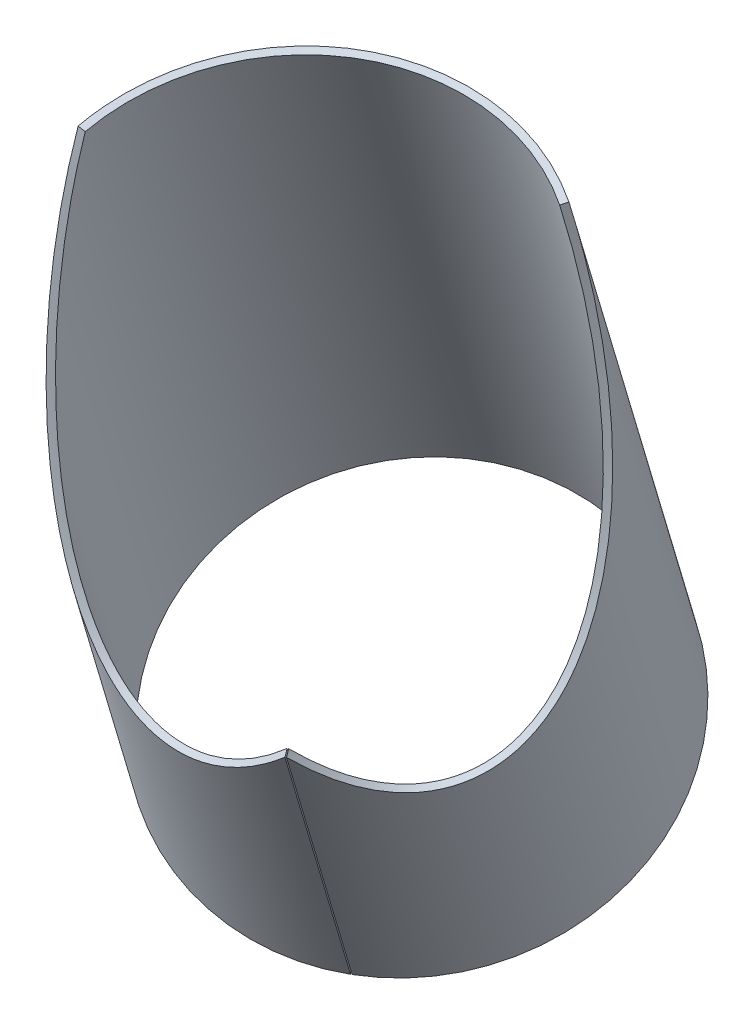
ISO-10303-21;
HEADER;
FILE_DESCRIPTION(('STEP AP214'),'2;1');
FILE_NAME('part.step','',(''),(''),'','','');
FILE_SCHEMA(('AUTOMOTIVE_DESIGN { 1 0 10303 214 1 1 1 1 }'));
ENDSEC;
DATA;
#1=APPLICATION_CONTEXT('core data for automotive mechanical design processes');
#2=APPLICATION_PROTOCOL_DEFINITION('international standard','automotive_design',2000,#1);
#3=PRODUCT_CONTEXT('',#1,'mechanical');
#4=PRODUCT('Part','Part','',(#3));
#5=PRODUCT_RELATED_PRODUCT_CATEGORY('part','',(#4));
#6=PRODUCT_DEFINITION_FORMATION('','',#4);
#7=PRODUCT_DEFINITION_CONTEXT('part definition',#1,'design');
#8=PRODUCT_DEFINITION('design','',#6,#7);
#9=PRODUCT_DEFINITION_SHAPE('','',#8);
#10=(LENGTH_UNIT() NAMED_UNIT(*) SI_UNIT(.MILLI.,.METRE.));
#11=(NAMED_UNIT(*) PLANE_ANGLE_UNIT() SI_UNIT($,.RADIAN.));
#12=(NAMED_UNIT(*) SI_UNIT($,.STERADIAN.) SOLID_ANGLE_UNIT());
#13=UNCERTAINTY_MEASURE_WITH_UNIT(LENGTH_MEASURE(1.E-05),#10,'distance_accuracy_value','');
#14=(GEOMETRIC_REPRESENTATION_CONTEXT(3) GLOBAL_UNCERTAINTY_ASSIGNED_CONTEXT((#13)) GLOBAL_UNIT_ASSIGNED_CONTEXT((#10,
#11,#12)) REPRESENTATION_CONTEXT('',''));
#15=CARTESIAN_POINT('',(0.,0.,0.));
#16=DIRECTION('',(0.,0.,1.));
#17=DIRECTION('',(1.,0.,0.));
#18=AXIS2_PLACEMENT_3D('',#15,#16,#17);
#19=CARTESIAN_POINT('',(-42.0601074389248,-492.249143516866,-71.883576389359));
#20=DIRECTION('',(0.867224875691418,-0.00138888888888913,-0.497914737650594));
#21=DIRECTION('',(0.249999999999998,0.866025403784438,0.433012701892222));
#22=AXIS2_PLACEMENT_3D('',#19,#20,#21);
#23=PLANE('',#22);
#24=DIRECTION('',(0.43060540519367,-0.499998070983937,0.751385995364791));
#25=VECTOR('',#24,1.);
#26=CARTESIAN_POINT('',(-80.9592321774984,-626.999664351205,-139.258836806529));
#27=LINE('',#26,#25);
#28=CARTESIAN_POINT('',(-80.9592321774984,-626.999664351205,-139.258836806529));
#29=VERTEX_POINT('',#28);
#30=CARTESIAN_POINT('',(-78.3755997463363,-629.999652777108,-134.75052083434));
#31=VERTEX_POINT('',#30);
#32=EDGE_CURVE('E13',#29,#31,#27,.T.);
#33=ORIENTED_EDGE('',*,*,#32,.F.);
#34=DIRECTION('',(0.249999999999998,0.866025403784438,0.433012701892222));
#35=VECTOR('',#34,1.);
#36=CARTESIAN_POINT('',(-80.9592321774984,-626.999664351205,-139.258836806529));
#37=LINE('',#36,#35);
#38=CARTESIAN_POINT('',(-3.1609827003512,-357.498622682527,-4.50831597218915));
#39=VERTEX_POINT('',#38);
#40=EDGE_CURVE('E102',#29,#39,#37,.T.);
#41=ORIENTED_EDGE('',*,*,#40,.T.);
#42=CARTESIAN_POINT('',(-0.577350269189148,-360.498611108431,-3.84241249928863E-13));
#43=CARTESIAN_POINT('',(-3.16098270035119,-357.498622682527,-4.50831597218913));
#44=B_SPLINE_CURVE_WITH_KNOTS('',1,(#42,#43),.UNSPECIFIED.,.F.,.F.,(2,2),(0.,1.),.UNSPECIFIED.);
#45=CARTESIAN_POINT('',(-0.577350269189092,-360.49861110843,2.22044604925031E-13));
#46=VERTEX_POINT('',#45);
#47=EDGE_CURVE('E50',#39,#46,#44,.F.);
#48=ORIENTED_EDGE('',*,*,#47,.T.);
#49=DIRECTION('',(0.249999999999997,0.866025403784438,0.433012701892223));
#50=VECTOR('',#49,1.);
#51=CARTESIAN_POINT('',(-413.451756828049,-1790.73750971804,-715.11944930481));
#52=LINE('',#51,#50);
#53=EDGE_CURVE('E101',#31,#46,#52,.T.);
#54=ORIENTED_EDGE('',*,*,#53,.F.);
#55=EDGE_LOOP('',(#33,#41,#48,#54));
#56=FACE_BOUND('',#55,.T.);
#57=ADVANCED_FACE('F40',(#56),#23,.T.);
#58=CARTESIAN_POINT('',(-180.,24.1154273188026,-9.64397832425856E-13));
#59=CARTESIAN_POINT('',(-182.461083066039,14.6007842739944,0.00014389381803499));
#60=CARTESIAN_POINT('',(-184.557941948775,5.89288400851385,0.00060696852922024));
#61=CARTESIAN_POINT('',(-186.810539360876,-3.95829779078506,0.000223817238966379));
#62=CARTESIAN_POINT('',(-187.242572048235,-5.87687673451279,0.000133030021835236));
#63=CARTESIAN_POINT('',(-188.071583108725,-9.61020880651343,9.26974379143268E-06));
#64=CARTESIAN_POINT('',(-188.466165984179,-11.4137400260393,-2.39107263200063E-06));
#65=CARTESIAN_POINT('',(-189.6237148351,-16.778202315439,3.87627210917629E-05));
#66=CARTESIAN_POINT('',(-190.357859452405,-20.2826731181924,0.000126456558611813));
#67=CARTESIAN_POINT('',(-192.454843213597,-30.5783400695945,0.000268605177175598));
#68=CARTESIAN_POINT('',(-193.71232683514,-37.1517226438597,0.000120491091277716));
#69=CARTESIAN_POINT('',(-195.415013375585,-46.5685711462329,-1.53885423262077E-05));
#70=CARTESIAN_POINT('',(-195.951796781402,-49.6319005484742,1.10223983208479E-05));
#71=CARTESIAN_POINT('',(-196.982891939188,-55.6979803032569,8.82721286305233E-05));
#72=CARTESIAN_POINT('',(-197.475181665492,-58.6897998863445,0.000133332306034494));
#73=CARTESIAN_POINT('',(-198.88563001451,-67.5405807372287,0.000189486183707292));
#74=CARTESIAN_POINT('',(-199.737395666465,-73.2748390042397,8.74328922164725E-05));
#75=CARTESIAN_POINT('',(-200.895174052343,-81.6232345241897,-6.72985425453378E-06));
#76=CARTESIAN_POINT('',(-201.260777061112,-84.3609839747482,-2.49691232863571E-07));
#77=CARTESIAN_POINT('',(-201.958548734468,-89.7872544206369,5.07940251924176E-05));
#78=CARTESIAN_POINT('',(-202.290146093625,-92.4718534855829,8.69713769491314E-05));
#79=CARTESIAN_POINT('',(-203.235023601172,-100.439442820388,0.000155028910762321));
#80=CARTESIAN_POINT('',(-203.798400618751,-105.636212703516,0.00012798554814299));
#81=CARTESIAN_POINT('',(-204.8022144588,-115.796951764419,8.76250503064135E-06));
#82=CARTESIAN_POINT('',(-205.242103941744,-120.752892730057,-5.27277112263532E-06));
#83=CARTESIAN_POINT('',(-206.399799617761,-135.371496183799,0.000138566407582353));
#84=CARTESIAN_POINT('',(-206.952814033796,-144.760780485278,3.74144337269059E-05));
#85=CARTESIAN_POINT('',(-207.674396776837,-162.81137585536,-3.16573914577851E-05));
#86=CARTESIAN_POINT('',(-207.845410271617,-171.532135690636,0.00029952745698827));
#87=CARTESIAN_POINT('',(-207.84651395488,-188.391103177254,0.000163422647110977));
#88=CARTESIAN_POINT('',(-207.677035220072,-196.515473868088,-0.000124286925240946));
#89=CARTESIAN_POINT('',(-207.026596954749,-212.256449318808,-3.3545841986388E-05));
#90=CARTESIAN_POINT('',(-206.545539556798,-219.862323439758,-4.51189139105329E-05));
#91=CARTESIAN_POINT('',(-205.299398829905,-234.536939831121,-2.73545987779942E-05));
#92=CARTESIAN_POINT('',(-204.532514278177,-241.626401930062,0.000122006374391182));
#93=CARTESIAN_POINT('',(-202.73335756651,-255.309182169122,8.01220048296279E-05));
#94=CARTESIAN_POINT('',(-201.702153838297,-261.895844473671,-6.60017474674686E-06));
#95=CARTESIAN_POINT('',(-199.391737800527,-274.593293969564,0.000156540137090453));
#96=CARTESIAN_POINT('',(-198.111560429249,-280.708656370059,0.000189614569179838));
#97=CARTESIAN_POINT('',(-195.319702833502,-292.467269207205,2.81779833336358E-05));
#98=CARTESIAN_POINT('',(-193.809297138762,-298.106003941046,-4.66875268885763E-05));
#99=CARTESIAN_POINT('',(-188.947870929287,-314.342156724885,0.000337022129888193));
#100=CARTESIAN_POINT('',(-185.262965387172,-324.270831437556,5.14679362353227E-05));
#101=CARTESIAN_POINT('',(-177.125928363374,-342.303283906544,-1.10318340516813E-05));
#102=CARTESIAN_POINT('',(-172.657511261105,-350.443320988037,0.000436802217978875));
#103=CARTESIAN_POINT('',(-163.020167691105,-364.950788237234,-3.23293386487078E-05));
#104=CARTESIAN_POINT('',(-157.853584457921,-371.315045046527,3.89803274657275E-05));
#105=CARTESIAN_POINT('',(-146.884406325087,-382.293952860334,-4.43082888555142E-05));
#106=CARTESIAN_POINT('',(-141.08102211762,-386.907267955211,-3.24649269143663E-05));
#107=CARTESIAN_POINT('',(-122.82356398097,-398.107543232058,5.67010380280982E-05));
#108=CARTESIAN_POINT('',(-109.498505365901,-402.071545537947,-1.37531779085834E-05));
#109=CARTESIAN_POINT('',(-88.1680375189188,-402.655029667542,-7.76606030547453E-06));
#110=CARTESIAN_POINT('',(-80.8237648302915,-401.954685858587,0.000402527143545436));
#111=CARTESIAN_POINT('',(-65.7387071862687,-398.735544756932,7.090344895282E-05));
#112=CARTESIAN_POINT('',(-58.0055462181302,-396.219132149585,0.000158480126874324));
#113=CARTESIAN_POINT('',(-42.1706997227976,-389.31539919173,0.000483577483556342));
#114=CARTESIAN_POINT('',(-34.083415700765,-384.933871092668,-8.02939817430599E-06));
#115=CARTESIAN_POINT('',(-21.7470296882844,-376.929555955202,-6.32759911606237E-05));
#116=CARTESIAN_POINT('',(-17.5965675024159,-374.01980324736,-2.96445998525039E-06));
#117=CARTESIAN_POINT('',(-11.3331927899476,-369.297538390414,-7.12891796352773E-06));
#118=CARTESIAN_POINT('',(-9.24121359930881,-367.665555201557,-4.65774962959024E-05));
#119=CARTESIAN_POINT('',(-6.09523039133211,-365.128331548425,3.23558199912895E-05));
#120=CARTESIAN_POINT('',(-5.04812658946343,-364.270258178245,4.56033876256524E-06));
#121=CARTESIAN_POINT('',(-2.93448915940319,-362.510019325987,6.37608766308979E-05));
#122=CARTESIAN_POINT('',(-1.79597798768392,-361.546755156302,0.000901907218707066));
#123=CARTESIAN_POINT('',(-0.577350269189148,-360.498611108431,-3.84241249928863E-13));
#124=CARTESIAN_POINT('',(-174.200961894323,22.6154273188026,-0.348076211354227));
#125=CARTESIAN_POINT('',(-176.653799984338,13.1623197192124,-0.475749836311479));
#126=CARTESIAN_POINT('',(-178.747975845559,4.51185201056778,-0.591714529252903));
#127=CARTESIAN_POINT('',(-181.001275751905,-5.27349811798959,-0.723355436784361));
#128=CARTESIAN_POINT('',(-181.433653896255,-7.17920796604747,-0.748984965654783));
#129=CARTESIAN_POINT('',(-182.263701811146,-10.8874133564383,-0.798763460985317));
#130=CARTESIAN_POINT('',(-182.658969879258,-12.678762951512,-0.822742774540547));
#131=CARTESIAN_POINT('',(-183.819059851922,-18.0068747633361,-0.893935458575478));
#132=CARTESIAN_POINT('',(-184.555553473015,-21.4874387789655,-0.940305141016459));
#133=CARTESIAN_POINT('',(-186.661308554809,-31.7124404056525,-1.07642951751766));
#134=CARTESIAN_POINT('',(-187.926935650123,-38.2401217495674,-1.16327845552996));
#135=CARTESIAN_POINT('',(-189.644373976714,-47.5907862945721,-1.28726530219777));
#136=CARTESIAN_POINT('',(-190.186490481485,-50.6324615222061,-1.32746817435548));
#137=CARTESIAN_POINT('',(-191.229141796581,-56.6554309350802,-1.40693965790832));
#138=CARTESIAN_POINT('',(-191.727638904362,-59.6258709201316,-1.44606996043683));
#139=CARTESIAN_POINT('',(-193.15788554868,-68.4130735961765,-1.56173960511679));
#140=CARTESIAN_POINT('',(-194.02441733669,-74.1056947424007,-1.63659066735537));
#141=CARTESIAN_POINT('',(-195.2062648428,-82.3928770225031,-1.74521499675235));
#142=CARTESIAN_POINT('',(-195.58020073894,-85.1104503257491,-1.78074981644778));
#143=CARTESIAN_POINT('',(-196.295327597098,-90.496536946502,-1.85104640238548));
#144=CARTESIAN_POINT('',(-196.635936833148,-93.1611569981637,-1.8857652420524));
#145=CARTESIAN_POINT('',(-197.608787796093,-101.069167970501,-1.98870342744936));
#146=CARTESIAN_POINT('',(-198.192063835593,-106.226697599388,-2.0557222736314));
#147=CARTESIAN_POINT('',(-199.23783774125,-116.310009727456,-2.18646970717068));
#148=CARTESIAN_POINT('',(-199.69974715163,-121.22782598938,-2.25001993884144));
#149=CARTESIAN_POINT('',(-200.926765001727,-135.732960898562,-2.43679001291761));
#150=CARTESIAN_POINT('',(-201.530259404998,-145.04799346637,-2.55624999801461));
#151=CARTESIAN_POINT('',(-202.35956188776,-162.953375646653,-2.78455342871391));
#152=CARTESIAN_POINT('',(-202.588166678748,-171.602692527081,-2.89385780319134));
#153=CARTESIAN_POINT('',(-202.710905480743,-188.321178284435,-3.10473129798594));
#154=CARTESIAN_POINT('',(-202.605356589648,-196.376626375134,-3.20595429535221));
#155=CARTESIAN_POINT('',(-202.088844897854,-211.981731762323,-3.40028113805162));
#156=CARTESIAN_POINT('',(-201.677711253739,-219.520752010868,-3.49362995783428));
#157=CARTESIAN_POINT('',(-200.576417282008,-234.064086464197,-3.6725487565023));
#158=CARTESIAN_POINT('',(-199.884661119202,-241.088933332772,-3.75825446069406));
#159=CARTESIAN_POINT('',(-198.24047516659,-254.64470663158,-3.92283781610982));
#160=CARTESIAN_POINT('',(-197.289032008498,-261.169039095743,-4.00153443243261));
#161=CARTESIAN_POINT('',(-195.142451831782,-273.744000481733,-4.15175683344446));
#162=CARTESIAN_POINT('',(-193.946413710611,-279.799162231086,-4.22354724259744));
#163=CARTESIAN_POINT('',(-191.32666272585,-291.439640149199,-4.36061271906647));
#164=CARTESIAN_POINT('',(-189.904151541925,-297.020485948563,-4.42571953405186));
#165=CARTESIAN_POINT('',(-185.311817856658,-313.086248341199,-4.61075596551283));
#166=CARTESIAN_POINT('',(-181.813720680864,-322.905594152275,-4.72184546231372));
#167=CARTESIAN_POINT('',(-174.061104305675,-340.729052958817,-4.91794992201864));
#168=CARTESIAN_POINT('',(-169.791069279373,-348.769002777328,-5.0031406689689));
#169=CARTESIAN_POINT('',(-160.559593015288,-363.086028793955,-5.15016466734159));
#170=CARTESIAN_POINT('',(-155.6003953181,-369.35996263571,-5.21100519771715));
#171=CARTESIAN_POINT('',(-145.05323774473,-380.16821736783,-5.30874096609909));
#172=CARTESIAN_POINT('',(-139.464502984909,-384.701205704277,-5.34545472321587));
#173=CARTESIAN_POINT('',(-121.858421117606,-395.676382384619,-5.41949048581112));
#174=CARTESIAN_POINT('',(-108.978378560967,-399.511186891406,-5.42102639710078));
#175=CARTESIAN_POINT('',(-88.3186987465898,-399.935869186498,-5.3513444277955));
#176=CARTESIAN_POINT('',(-81.1988788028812,-399.188353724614,-5.31568958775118));
#177=CARTESIAN_POINT('',(-66.561998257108,-395.887175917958,-5.22133945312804));
#178=CARTESIAN_POINT('',(-59.0523376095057,-393.335923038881,-5.16189444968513));
#179=CARTESIAN_POINT('',(-43.6625054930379,-386.375438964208,-5.01814241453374));
#180=CARTESIAN_POINT('',(-35.7963299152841,-381.972064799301,-4.93466913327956));
#181=CARTESIAN_POINT('',(-23.7876899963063,-373.945422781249,-4.79015384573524));
#182=CARTESIAN_POINT('',(-19.7459302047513,-371.029963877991,-4.73874656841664));
#183=CARTESIAN_POINT('',(-13.6442059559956,-366.301849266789,-4.65712130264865));
#184=CARTESIAN_POINT('',(-11.6058234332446,-364.668368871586,-4.62921111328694));
#185=CARTESIAN_POINT('',(-8.53984108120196,-362.129583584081,-4.58606693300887));
#186=CARTESIAN_POINT('',(-7.51926676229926,-361.271104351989,-4.57158964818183));
#187=CARTESIAN_POINT('',(-5.45897685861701,-359.510279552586,-4.54190213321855));
#188=CARTESIAN_POINT('',(-4.34908931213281,-358.54681555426,-4.52493763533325));
#189=CARTESIAN_POINT('',(-3.16098270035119,-357.498622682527,-4.50831597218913));
#190=B_SPLINE_SURFACE_WITH_KNOTS('',1,3,((#58,#59,#60,#61,#62,#63,#64,#65,#66,#67,#68,#69,#70,
#71,#72,#73,#74,#75,#76,#77,#78,#79,#80,#81,#82,#83,#84,#85,#86,#87,#88,#89,#90,#91,#92,#93,#94,
#95,#96,#97,#98,#99,#100,#101,#102,#103,#104,#105,#106,#107,#108,#109,#110,#111,#112,#113,#114,
#115,#116,#117,#118,#119,#120,#121,#122,#123),(#124,#125,#126,#127,#128,#129,#130,#131,#132,
#133,#134,#135,#136,#137,#138,#139,#140,#141,#142,#143,#144,#145,#146,#147,#148,#149,#150,#151,
#152,#153,#154,#155,#156,#157,#158,#159,#160,#161,#162,#163,#164,#165,#166,#167,#168,#169,#170,
#171,#172,#173,#174,#175,#176,#177,#178,#179,#180,#181,#182,#183,#184,#185,#186,#187,#188,
#189)),.UNSPECIFIED.,.F.,.F.,.F.,(2,2),(4,2,2,2,2,2,2,2,2,2,2,2,2,2,2,2,2,2,2,2,2,2,2,2,2,2,2,2,
2,2,2,2,4),(0.,1.),(0.,0.015625,0.01953125,0.0234375,0.03125,0.046875,0.0546875,0.0625,0.078125,
0.0859375,0.09375,0.109375,0.125,0.15625,0.1875,0.21875,0.25,0.28125,0.3125,0.34375,0.375,
0.4375,0.5,0.5625,0.625,0.75,0.8125,0.875,0.9375,0.96875,0.984375,0.9921875,1.),.UNSPECIFIED.);
#191=CARTESIAN_POINT('',(-3.16098270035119,-357.498622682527,-4.50831597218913));
#192=CARTESIAN_POINT('',(-4.34908931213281,-358.54681555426,-4.52493763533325));
#193=CARTESIAN_POINT('',(-5.45897685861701,-359.510279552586,-4.54190213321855));
#194=CARTESIAN_POINT('',(-7.51926676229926,-361.271104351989,-4.57158964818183));
#195=CARTESIAN_POINT('',(-8.53984108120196,-362.129583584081,-4.58606693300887));
#196=CARTESIAN_POINT('',(-11.6058234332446,-364.668368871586,-4.62921111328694));
#197=CARTESIAN_POINT('',(-13.6442059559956,-366.301849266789,-4.65712130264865));
#198=CARTESIAN_POINT('',(-19.7459302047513,-371.029963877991,-4.73874656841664));
#199=CARTESIAN_POINT('',(-23.7876899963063,-373.945422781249,-4.79015384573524));
#200=CARTESIAN_POINT('',(-35.7963299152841,-381.972064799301,-4.93466913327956));
#201=CARTESIAN_POINT('',(-43.6625054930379,-386.375438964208,-5.01814241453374));
#202=CARTESIAN_POINT('',(-59.0523376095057,-393.335923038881,-5.16189444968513));
#203=CARTESIAN_POINT('',(-66.561998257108,-395.887175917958,-5.22133945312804));
#204=CARTESIAN_POINT('',(-81.1988788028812,-399.188353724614,-5.31568958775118));
#205=CARTESIAN_POINT('',(-88.3186987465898,-399.935869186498,-5.3513444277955));
#206=CARTESIAN_POINT('',(-108.978378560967,-399.511186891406,-5.42102639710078));
#207=CARTESIAN_POINT('',(-121.858421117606,-395.676382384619,-5.41949048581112));
#208=CARTESIAN_POINT('',(-139.464502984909,-384.701205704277,-5.34545472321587));
#209=CARTESIAN_POINT('',(-145.05323774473,-380.16821736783,-5.30874096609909));
#210=CARTESIAN_POINT('',(-155.6003953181,-369.35996263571,-5.21100519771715));
#211=CARTESIAN_POINT('',(-160.559593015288,-363.086028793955,-5.15016466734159));
#212=CARTESIAN_POINT('',(-169.791069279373,-348.769002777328,-5.0031406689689));
#213=CARTESIAN_POINT('',(-174.061104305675,-340.729052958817,-4.91794992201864));
#214=CARTESIAN_POINT('',(-181.813720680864,-322.905594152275,-4.72184546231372));
#215=CARTESIAN_POINT('',(-185.311817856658,-313.086248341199,-4.61075596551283));
#216=CARTESIAN_POINT('',(-189.904151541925,-297.020485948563,-4.42571953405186));
#217=CARTESIAN_POINT('',(-191.32666272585,-291.439640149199,-4.36061271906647));
#218=CARTESIAN_POINT('',(-193.946413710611,-279.799162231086,-4.22354724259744));
#219=CARTESIAN_POINT('',(-195.142451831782,-273.744000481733,-4.15175683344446));
#220=CARTESIAN_POINT('',(-197.289032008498,-261.169039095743,-4.00153443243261));
#221=CARTESIAN_POINT('',(-198.24047516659,-254.64470663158,-3.92283781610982));
#222=CARTESIAN_POINT('',(-199.884661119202,-241.088933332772,-3.75825446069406));
#223=CARTESIAN_POINT('',(-200.576417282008,-234.064086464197,-3.6725487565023));
#224=CARTESIAN_POINT('',(-201.677711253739,-219.520752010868,-3.49362995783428));
#225=CARTESIAN_POINT('',(-202.088844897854,-211.981731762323,-3.40028113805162));
#226=CARTESIAN_POINT('',(-202.605356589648,-196.376626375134,-3.20595429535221));
#227=CARTESIAN_POINT('',(-202.710905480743,-188.321178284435,-3.10473129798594));
#228=CARTESIAN_POINT('',(-202.588166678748,-171.602692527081,-2.89385780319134));
#229=CARTESIAN_POINT('',(-202.35956188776,-162.953375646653,-2.78455342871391));
#230=CARTESIAN_POINT('',(-201.530259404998,-145.04799346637,-2.55624999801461));
#231=CARTESIAN_POINT('',(-200.926765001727,-135.732960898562,-2.43679001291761));
#232=CARTESIAN_POINT('',(-199.69974715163,-121.22782598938,-2.25001993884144));
#233=CARTESIAN_POINT('',(-199.23783774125,-116.310009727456,-2.18646970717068));
#234=CARTESIAN_POINT('',(-198.192063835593,-106.226697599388,-2.0557222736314));
#235=CARTESIAN_POINT('',(-197.608787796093,-101.069167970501,-1.98870342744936));
#236=CARTESIAN_POINT('',(-196.635936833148,-93.1611569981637,-1.8857652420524));
#237=CARTESIAN_POINT('',(-196.295327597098,-90.496536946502,-1.85104640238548));
#238=CARTESIAN_POINT('',(-195.58020073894,-85.1104503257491,-1.78074981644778));
#239=CARTESIAN_POINT('',(-195.2062648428,-82.3928770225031,-1.74521499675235));
#240=CARTESIAN_POINT('',(-194.02441733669,-74.1056947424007,-1.63659066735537));
#241=CARTESIAN_POINT('',(-193.15788554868,-68.4130735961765,-1.56173960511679));
#242=CARTESIAN_POINT('',(-191.727638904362,-59.6258709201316,-1.44606996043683));
#243=CARTESIAN_POINT('',(-191.229141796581,-56.6554309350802,-1.40693965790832));
#244=CARTESIAN_POINT('',(-190.186490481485,-50.6324615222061,-1.32746817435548));
#245=CARTESIAN_POINT('',(-189.644373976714,-47.5907862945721,-1.28726530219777));
#246=CARTESIAN_POINT('',(-187.926935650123,-38.2401217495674,-1.16327845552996));
#247=CARTESIAN_POINT('',(-186.661308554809,-31.7124404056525,-1.07642951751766));
#248=CARTESIAN_POINT('',(-184.555553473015,-21.4874387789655,-0.940305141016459));
#249=CARTESIAN_POINT('',(-183.819059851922,-18.0068747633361,-0.893935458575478));
#250=CARTESIAN_POINT('',(-182.658969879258,-12.678762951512,-0.822742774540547));
#251=CARTESIAN_POINT('',(-182.263701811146,-10.8874133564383,-0.798763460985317));
#252=CARTESIAN_POINT('',(-181.433653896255,-7.17920796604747,-0.748984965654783));
#253=CARTESIAN_POINT('',(-181.001275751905,-5.27349811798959,-0.723355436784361));
#254=CARTESIAN_POINT('',(-178.747975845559,4.51185201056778,-0.591714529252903));
#255=CARTESIAN_POINT('',(-176.653799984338,13.1623197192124,-0.475749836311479));
#256=CARTESIAN_POINT('',(-174.200961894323,22.6154273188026,-0.348076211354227));
#257=B_SPLINE_CURVE_WITH_KNOTS('',3,(#191,#192,#193,#194,#195,#196,#197,#198,#199,#200,#201,
#202,#203,#204,#205,#206,#207,#208,#209,#210,#211,#212,#213,#214,#215,#216,#217,#218,#219,#220,
#221,#222,#223,#224,#225,#226,#227,#228,#229,#230,#231,#232,#233,#234,#235,#236,#237,#238,#239,
#240,#241,#242,#243,#244,#245,#246,#247,#248,#249,#250,#251,#252,#253,#254,#255,#256),
.UNSPECIFIED.,.F.,.F.,(4,2,2,2,2,2,2,2,2,2,2,2,2,2,2,2,2,2,2,2,2,2,2,2,2,2,2,2,2,2,2,2,4),(0.,
0.0078125,0.015625,0.03125,0.0625,0.125,0.1875,0.25,0.375,0.4375,0.5,0.5625,0.625,0.65625,
0.6875,0.71875,0.75,0.78125,0.8125,0.84375,0.875,0.890625,0.90625,0.9140625,0.921875,0.9375,
0.9453125,0.953125,0.96875,0.9765625,0.98046875,0.984375,1.),.UNSPECIFIED.);
#258=CARTESIAN_POINT('',(-174.200961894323,22.6154273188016,-0.348076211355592));
#259=VERTEX_POINT('',#258);
#260=EDGE_CURVE('E187',#259,#39,#257,.F.);
#261=CARTESIAN_POINT('',(-174.200961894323,22.6154273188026,-0.348076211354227));
#262=CARTESIAN_POINT('',(-180.,24.1154273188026,-9.64397832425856E-13));
#263=B_SPLINE_CURVE_WITH_KNOTS('',1,(#261,#262),.UNSPECIFIED.,.F.,.F.,(2,2),(0.,1.),.UNSPECIFIED.);
#264=CARTESIAN_POINT('',(-180.000000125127,24.115426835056,6.19122808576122E-12));
#265=VERTEX_POINT('',#264);
#266=EDGE_CURVE('E108',#259,#265,#263,.T.);
#267=CARTESIAN_POINT('',(-180.,24.1154273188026,-9.64397832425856E-13));
#268=CARTESIAN_POINT('',(-182.461083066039,14.6007842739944,0.00014389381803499));
#269=CARTESIAN_POINT('',(-184.557941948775,5.89288400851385,0.00060696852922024));
#270=CARTESIAN_POINT('',(-186.810539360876,-3.95829779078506,0.000223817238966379));
#271=CARTESIAN_POINT('',(-187.242572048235,-5.87687673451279,0.000133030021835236));
#272=CARTESIAN_POINT('',(-188.071583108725,-9.61020880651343,9.26974379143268E-06));
#273=CARTESIAN_POINT('',(-188.466165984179,-11.4137400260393,-2.39107263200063E-06));
#274=CARTESIAN_POINT('',(-189.6237148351,-16.778202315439,3.87627210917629E-05));
#275=CARTESIAN_POINT('',(-190.357859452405,-20.2826731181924,0.000126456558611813));
#276=CARTESIAN_POINT('',(-192.454843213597,-30.5783400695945,0.000268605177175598));
#277=CARTESIAN_POINT('',(-193.71232683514,-37.1517226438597,0.000120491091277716));
#278=CARTESIAN_POINT('',(-195.415013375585,-46.5685711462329,-1.53885423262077E-05));
#279=CARTESIAN_POINT('',(-195.951796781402,-49.6319005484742,1.10223983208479E-05));
#280=CARTESIAN_POINT('',(-196.982891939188,-55.6979803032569,8.82721286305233E-05));
#281=CARTESIAN_POINT('',(-197.475181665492,-58.6897998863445,0.000133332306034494));
#282=CARTESIAN_POINT('',(-198.88563001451,-67.5405807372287,0.000189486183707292));
#283=CARTESIAN_POINT('',(-199.737395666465,-73.2748390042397,8.74328922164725E-05));
#284=CARTESIAN_POINT('',(-200.895174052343,-81.6232345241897,-6.72985425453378E-06));
#285=CARTESIAN_POINT('',(-201.260777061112,-84.3609839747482,-2.49691232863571E-07));
#286=CARTESIAN_POINT('',(-201.958548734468,-89.7872544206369,5.07940251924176E-05));
#287=CARTESIAN_POINT('',(-202.290146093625,-92.4718534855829,8.69713769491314E-05));
#288=CARTESIAN_POINT('',(-203.235023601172,-100.439442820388,0.000155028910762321));
#289=CARTESIAN_POINT('',(-203.798400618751,-105.636212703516,0.00012798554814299));
#290=CARTESIAN_POINT('',(-204.8022144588,-115.796951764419,8.76250503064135E-06));
#291=CARTESIAN_POINT('',(-205.242103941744,-120.752892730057,-5.27277112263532E-06));
#292=CARTESIAN_POINT('',(-206.399799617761,-135.371496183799,0.000138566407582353));
#293=CARTESIAN_POINT('',(-206.952814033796,-144.760780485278,3.74144337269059E-05));
#294=CARTESIAN_POINT('',(-207.674396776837,-162.81137585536,-3.16573914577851E-05));
#295=CARTESIAN_POINT('',(-207.845410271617,-171.532135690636,0.00029952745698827));
#296=CARTESIAN_POINT('',(-207.84651395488,-188.391103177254,0.000163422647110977));
#297=CARTESIAN_POINT('',(-207.677035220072,-196.515473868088,-0.000124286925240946));
#298=CARTESIAN_POINT('',(-207.026596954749,-212.256449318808,-3.3545841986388E-05));
#299=CARTESIAN_POINT('',(-206.545539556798,-219.862323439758,-4.51189139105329E-05));
#300=CARTESIAN_POINT('',(-205.299398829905,-234.536939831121,-2.73545987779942E-05));
#301=CARTESIAN_POINT('',(-204.532514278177,-241.626401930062,0.000122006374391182));
#302=CARTESIAN_POINT('',(-202.73335756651,-255.309182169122,8.01220048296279E-05));
#303=CARTESIAN_POINT('',(-201.702153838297,-261.895844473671,-6.60017474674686E-06));
#304=CARTESIAN_POINT('',(-199.391737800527,-274.593293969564,0.000156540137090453));
#305=CARTESIAN_POINT('',(-198.111560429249,-280.708656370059,0.000189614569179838));
#306=CARTESIAN_POINT('',(-195.319702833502,-292.467269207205,2.81779833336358E-05));
#307=CARTESIAN_POINT('',(-193.809297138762,-298.106003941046,-4.66875268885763E-05));
#308=CARTESIAN_POINT('',(-188.947870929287,-314.342156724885,0.000337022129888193));
#309=CARTESIAN_POINT('',(-185.262965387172,-324.270831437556,5.14679362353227E-05));
#310=CARTESIAN_POINT('',(-177.125928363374,-342.303283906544,-1.10318340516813E-05));
#311=CARTESIAN_POINT('',(-172.657511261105,-350.443320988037,0.000436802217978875));
#312=CARTESIAN_POINT('',(-163.020167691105,-364.950788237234,-3.23293386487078E-05));
#313=CARTESIAN_POINT('',(-157.853584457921,-371.315045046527,3.89803274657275E-05));
#314=CARTESIAN_POINT('',(-146.884406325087,-382.293952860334,-4.43082888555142E-05));
#315=CARTESIAN_POINT('',(-141.08102211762,-386.907267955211,-3.24649269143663E-05));
#316=CARTESIAN_POINT('',(-122.82356398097,-398.107543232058,5.67010380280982E-05));
#317=CARTESIAN_POINT('',(-109.498505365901,-402.071545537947,-1.37531779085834E-05));
#318=CARTESIAN_POINT('',(-88.1680375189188,-402.655029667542,-7.76606030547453E-06));
#319=CARTESIAN_POINT('',(-80.8237648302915,-401.954685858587,0.000402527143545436));
#320=CARTESIAN_POINT('',(-65.7387071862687,-398.735544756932,7.090344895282E-05));
#321=CARTESIAN_POINT('',(-58.0055462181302,-396.219132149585,0.000158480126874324));
#322=CARTESIAN_POINT('',(-42.1706997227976,-389.31539919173,0.000483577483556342));
#323=CARTESIAN_POINT('',(-34.083415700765,-384.933871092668,-8.02939817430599E-06));
#324=CARTESIAN_POINT('',(-21.7470296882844,-376.929555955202,-6.32759911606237E-05));
#325=CARTESIAN_POINT('',(-17.5965675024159,-374.01980324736,-2.96445998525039E-06));
#326=CARTESIAN_POINT('',(-11.3331927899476,-369.297538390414,-7.12891796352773E-06));
#327=CARTESIAN_POINT('',(-9.24121359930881,-367.665555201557,-4.65774962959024E-05));
#328=CARTESIAN_POINT('',(-6.09523039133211,-365.128331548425,3.23558199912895E-05));
#329=CARTESIAN_POINT('',(-5.04812658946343,-364.270258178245,4.56033876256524E-06));
#330=CARTESIAN_POINT('',(-2.93448915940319,-362.510019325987,6.37608766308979E-05));
#331=CARTESIAN_POINT('',(-1.79597798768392,-361.546755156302,0.000901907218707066));
#332=CARTESIAN_POINT('',(-0.577350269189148,-360.498611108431,-3.84241249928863E-13));
#333=B_SPLINE_CURVE_WITH_KNOTS('',3,(#267,#268,#269,#270,#271,#272,#273,#274,#275,#276,#277,
#278,#279,#280,#281,#282,#283,#284,#285,#286,#287,#288,#289,#290,#291,#292,#293,#294,#295,#296,
#297,#298,#299,#300,#301,#302,#303,#304,#305,#306,#307,#308,#309,#310,#311,#312,#313,#314,#315,
#316,#317,#318,#319,#320,#321,#322,#323,#324,#325,#326,#327,#328,#329,#330,#331,#332),
.UNSPECIFIED.,.F.,.F.,(4,2,2,2,2,2,2,2,2,2,2,2,2,2,2,2,2,2,2,2,2,2,2,2,2,2,2,2,2,2,2,2,4),(0.,
0.015625,0.01953125,0.0234375,0.03125,0.046875,0.0546875,0.0625,0.078125,0.0859375,0.09375,
0.109375,0.125,0.15625,0.1875,0.21875,0.25,0.28125,0.3125,0.34375,0.375,0.4375,0.5,0.5625,0.625,
0.75,0.8125,0.875,0.9375,0.96875,0.984375,0.9921875,1.),.UNSPECIFIED.);
#334=EDGE_CURVE('E116',#265,#46,#333,.T.);
#335=ORIENTED_EDGE('',*,*,#47,.F.);
#336=ORIENTED_EDGE('',*,*,#260,.F.);
#337=ORIENTED_EDGE('',*,*,#266,.T.);
#338=ORIENTED_EDGE('',*,*,#334,.T.);
#339=EDGE_LOOP('',(#335,#336,#337,#338));
#340=FACE_BOUND('',#339,.T.);
#341=ADVANCED_FACE('F121',(#340),#190,.F.);
#342=CARTESIAN_POINT('',(90.0000000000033,24.115427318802,-155.884572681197));
#343=CARTESIAN_POINT('',(88.2361057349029,24.5886650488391,-156.902770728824));
#344=CARTESIAN_POINT('',(86.5000131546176,25.0446002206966,-157.865199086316));
#345=CARTESIAN_POINT('',(83.9429078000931,25.7038586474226,-159.230908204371));
#346=CARTESIAN_POINT('',(83.0983741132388,25.919504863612,-159.673153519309));
#347=CARTESIAN_POINT('',(81.8439416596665,26.2369876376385,-160.31773718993));
#348=CARTESIAN_POINT('',(81.4278584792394,26.3418175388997,-160.529467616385));
#349=CARTESIAN_POINT('',(80.8068988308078,26.4975880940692,-160.842454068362));
#350=CARTESIAN_POINT('',(80.6004397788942,26.5492659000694,-160.946014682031));
#351=CARTESIAN_POINT('',(80.2915514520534,26.626416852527,-161.100214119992));
#352=CARTESIAN_POINT('',(80.1887220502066,26.6520728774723,-161.151423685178));
#353=CARTESIAN_POINT('',(80.0346791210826,26.6904658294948,-161.227954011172));
#354=CARTESIAN_POINT('',(79.9833650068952,26.7032482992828,-161.253416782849));
#355=CARTESIAN_POINT('',(79.8808040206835,26.7287829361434,-161.304247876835));
#356=CARTESIAN_POINT('',(79.8334105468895,26.7405767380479,-161.327710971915));
#357=CARTESIAN_POINT('',(78.0162141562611,27.1925252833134,-162.22618339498));
#358=CARTESIAN_POINT('',(76.2528123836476,27.6227649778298,-163.062132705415));
#359=CARTESIAN_POINT('',(73.60810456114,28.2560700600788,-164.264372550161));
#360=CARTESIAN_POINT('',(72.7265999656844,28.4651633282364,-164.65650579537));
#361=CARTESIAN_POINT('',(71.4047177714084,28.7757920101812,-165.231948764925));
#362=CARTESIAN_POINT('',(70.9641527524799,28.878833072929,-165.421636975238));
#363=CARTESIAN_POINT('',(70.3034328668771,29.0326424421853,-165.703000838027));
#364=CARTESIAN_POINT('',(70.0832141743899,29.0837868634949,-165.796260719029));
#365=CARTESIAN_POINT('',(69.7529222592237,29.1603155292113,-165.935361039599));
#366=CARTESIAN_POINT('',(69.6428309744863,29.1857937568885,-165.981596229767));
#367=CARTESIAN_POINT('',(69.4226611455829,29.2366875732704,-166.073803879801));
#368=CARTESIAN_POINT('',(69.3174128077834,29.2609892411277,-166.117764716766));
#369=CARTESIAN_POINT('',(65.5256457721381,30.1354297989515,-167.696911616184));
#370=CARTESIAN_POINT('',(61.8423831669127,30.9516819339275,-169.087609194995));
#371=CARTESIAN_POINT('',(56.3247206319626,32.1280952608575,-170.971617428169));
#372=CARTESIAN_POINT('',(54.4866899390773,32.5122480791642,-171.565956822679));
#373=CARTESIAN_POINT('',(51.7333960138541,33.0765251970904,-172.4081571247));
#374=CARTESIAN_POINT('',(50.8162557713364,33.2626260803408,-172.680672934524));
#375=CARTESIAN_POINT('',(49.4417192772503,33.5387979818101,-173.077272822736));
#376=CARTESIAN_POINT('',(48.9837360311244,33.6303587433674,-173.207443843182));
#377=CARTESIAN_POINT('',(48.2970836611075,33.7669563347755,-173.399676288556));
#378=CARTESIAN_POINT('',(48.0682532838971,33.8123649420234,-173.463249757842));
#379=CARTESIAN_POINT('',(47.7250919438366,33.8802921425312,-173.5578563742));
#380=CARTESIAN_POINT('',(47.6107188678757,33.9029035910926,-173.589266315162));
#381=CARTESIAN_POINT('',(47.3820013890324,33.9480646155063,-173.651835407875));
#382=CARTESIAN_POINT('',(47.2731704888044,33.9695282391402,-173.681497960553));
#383=CARTESIAN_POINT('',(43.3183425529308,34.7484802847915,-174.755006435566));
#384=CARTESIAN_POINT('',(39.4818853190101,35.4726079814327,-175.659941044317));
#385=CARTESIAN_POINT('',(33.7396097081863,36.5112657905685,-176.820310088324));
#386=CARTESIAN_POINT('',(31.8275753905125,36.8495700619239,-177.174269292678));
#387=CARTESIAN_POINT('',(28.9643388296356,37.3451292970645,-177.656911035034));
#388=CARTESIAN_POINT('',(28.0107284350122,37.5083332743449,-177.809742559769));
#389=CARTESIAN_POINT('',(26.5817253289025,37.7501662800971,-178.027038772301));
#390=CARTESIAN_POINT('',(26.1056263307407,37.8302818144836,-178.097479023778));
#391=CARTESIAN_POINT('',(25.3918567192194,37.9497122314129,-178.200167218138));
#392=CARTESIAN_POINT('',(25.1539966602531,37.9893985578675,-178.233901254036));
#393=CARTESIAN_POINT('',(24.7973044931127,38.0487423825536,-178.283761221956));
#394=CARTESIAN_POINT('',(24.6784234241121,38.0684927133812,-178.300257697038));
#395=CARTESIAN_POINT('',(24.4406944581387,38.1079314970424,-178.333003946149));
#396=CARTESIAN_POINT('',(24.326002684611,38.126932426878,-178.348689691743));
#397=CARTESIAN_POINT('',(20.2674261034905,38.7983188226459,-178.899480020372));
#398=CARTESIAN_POINT('',(16.3378974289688,39.4178178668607,-179.29995274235));
#399=CARTESIAN_POINT('',(10.4660441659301,40.2988604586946,-179.706143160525));
#400=CARTESIAN_POINT('',(8.51249172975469,40.5845130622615,-179.809127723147));
#401=CARTESIAN_POINT('',(5.5893562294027,41.0008912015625,-179.915790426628));
#402=CARTESIAN_POINT('',(4.61617606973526,41.1376674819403,-179.943376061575));
#403=CARTESIAN_POINT('',(3.15839802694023,41.3398031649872,-179.972905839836));
#404=CARTESIAN_POINT('',(2.67280401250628,41.4066769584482,-179.980774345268));
#405=CARTESIAN_POINT('',(1.9449350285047,41.5062301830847,-179.989628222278));
#406=CARTESIAN_POINT('',(1.70239903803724,41.5392883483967,-179.992088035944));
#407=CARTESIAN_POINT('',(1.33872854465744,41.5886862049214,-179.995042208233));
#408=CARTESIAN_POINT('',(1.21752729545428,41.6051205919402,-179.995904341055));
#409=CARTESIAN_POINT('',(0.975169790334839,41.6379262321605,-179.997383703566));
#410=CARTESIAN_POINT('',(0.858420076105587,41.6537030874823,-179.997982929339));
#411=CARTESIAN_POINT('',(-7.30168339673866,42.7544184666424,-180.03132286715));
#412=CARTESIAN_POINT('',(-15.2679687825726,43.7049240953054,-179.524759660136));
#413=CARTESIAN_POINT('',(-27.0131894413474,44.9259415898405,-178.004943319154));
#414=CARTESIAN_POINT('',(-30.8943389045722,45.2989121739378,-177.371788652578));
#415=CARTESIAN_POINT('',(-36.653496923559,45.8074710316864,-176.239288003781));
#416=CARTESIAN_POINT('',(-38.5627960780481,45.9685128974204,-175.83133217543));
#417=CARTESIAN_POINT('',(-41.4097233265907,46.1974231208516,-175.174646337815));
#418=CARTESIAN_POINT('',(-42.3558626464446,46.2716180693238,-174.94829270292));
#419=CARTESIAN_POINT('',(-43.7706474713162,46.3797585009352,-174.597693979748));
#420=CARTESIAN_POINT('',(-44.2415050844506,46.4152799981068,-174.47898304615));
#421=CARTESIAN_POINT('',(-44.9466645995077,46.4677757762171,-174.298164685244));
#422=CARTESIAN_POINT('',(-45.1815299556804,46.4851432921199,-174.237433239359));
#423=CARTESIAN_POINT('',(-45.5335436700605,46.5109981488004,-174.145649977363));
#424=CARTESIAN_POINT('',(-45.6508341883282,46.5195836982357,-174.114941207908));
#425=CARTESIAN_POINT('',(-45.8853200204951,46.5366893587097,-174.053295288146));
#426=CARTESIAN_POINT('',(-45.9991451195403,46.5449652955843,-174.023251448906));
#427=CARTESIAN_POINT('',(-61.5459298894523,47.6713395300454,-169.902411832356));
#428=CARTESIAN_POINT('',(-76.3344883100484,48.230855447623,-163.774357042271));
#429=CARTESIAN_POINT('',(-96.8327341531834,48.2308542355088,-151.939693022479));
#430=CARTESIAN_POINT('',(-103.425162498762,48.0921452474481,-147.533363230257));
#431=CARTESIAN_POINT('',(-112.860622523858,47.6727774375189,-140.278744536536));
#432=CARTESIAN_POINT('',(-115.930281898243,47.4978420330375,-137.753139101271));
#433=CARTESIAN_POINT('',(-120.410347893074,47.1829680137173,-133.810584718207));
#434=CARTESIAN_POINT('',(-121.882969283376,47.0692694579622,-132.470716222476));
#435=CARTESIAN_POINT('',(-124.059434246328,46.8856835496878,-130.423322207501));
#436=CARTESIAN_POINT('',(-124.779511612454,46.822315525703,-129.734592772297));
#437=CARTESIAN_POINT('',(-125.851342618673,46.7240161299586,-128.692222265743));
#438=CARTESIAN_POINT('',(-126.207238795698,46.6907084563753,-128.343219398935));
#439=CARTESIAN_POINT('',(-126.738990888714,46.6399367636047,-127.817411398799));
#440=CARTESIAN_POINT('',(-126.91589289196,46.6228778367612,-127.64175811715));
#441=CARTESIAN_POINT('',(-127.180720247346,46.597087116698,-127.377704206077));
#442=CARTESIAN_POINT('',(-127.268908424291,46.5884564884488,-127.289590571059));
#443=CARTESIAN_POINT('',(-127.445109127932,46.5711278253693,-127.113172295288));
#444=CARTESIAN_POINT('',(-127.535579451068,46.5621857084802,-127.022396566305));
#445=CARTESIAN_POINT('',(-133.09091419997,46.0104892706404,-121.43701851));
#446=CARTESIAN_POINT('',(-138.254084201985,45.3329165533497,-115.533664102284));
#447=CARTESIAN_POINT('',(-145.442880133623,44.111892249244,-106.121910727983));
#448=CARTESIAN_POINT('',(-147.746496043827,43.6708509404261,-102.892021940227));
#449=CARTESIAN_POINT('',(-151.05115703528,42.9585846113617,-97.9157294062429));
#450=CARTESIAN_POINT('',(-152.127585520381,42.7127170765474,-96.2350648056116));
#451=CARTESIAN_POINT('',(-153.703088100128,42.3313395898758,-93.6822397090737));
#452=CARTESIAN_POINT('',(-154.221732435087,42.2021180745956,-92.8259939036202));
#453=CARTESIAN_POINT('',(-154.989734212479,42.0051568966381,-91.5338021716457));
#454=CARTESIAN_POINT('',(-155.244074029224,41.9389817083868,-91.1017677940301));
#455=CARTESIAN_POINT('',(-155.62307020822,41.8389387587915,-90.4517775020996));
#456=CARTESIAN_POINT('',(-155.748983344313,41.805461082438,-90.2347909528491));
#457=CARTESIAN_POINT('',(-155.937221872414,41.7550497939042,-89.9088285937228));
#458=CARTESIAN_POINT('',(-155.999862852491,41.7382135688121,-89.8000940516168));
#459=CARTESIAN_POINT('',(-156.124933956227,41.7044762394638,-89.5824644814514));
#460=CARTESIAN_POINT('',(-156.189538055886,41.6869844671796,-89.4697682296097));
#461=CARTESIAN_POINT('',(-158.174504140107,41.1476703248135,-85.9990306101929));
#462=CARTESIAN_POINT('',(-160.002251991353,40.5923713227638,-82.5509442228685));
#463=CARTESIAN_POINT('',(-162.58637768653,39.7113115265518,-77.2626585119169));
#464=CARTESIAN_POINT('',(-163.421505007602,39.4096119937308,-75.4805476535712));
#465=CARTESIAN_POINT('',(-164.633354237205,38.9451427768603,-72.7794055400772));
#466=CARTESIAN_POINT('',(-165.03049716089,38.7883334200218,-71.8743628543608));
#467=CARTESIAN_POINT('',(-165.615818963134,38.5501557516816,-70.5099427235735));
#468=CARTESIAN_POINT('',(-165.80919414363,38.4702692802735,-70.0539933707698));
#469=CARTESIAN_POINT('',(-166.096636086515,38.349700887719,-69.368372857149));
#470=CARTESIAN_POINT('',(-166.192013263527,38.3093883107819,-69.139549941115));
#471=CARTESIAN_POINT('',(-166.334420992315,38.24873506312,-68.7958936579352));
#472=CARTESIAN_POINT('',(-166.3817805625,38.2284865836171,-68.6812712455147));
#473=CARTESIAN_POINT('',(-166.476279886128,38.1879282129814,-68.4518861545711));
#474=CARTESIAN_POINT('',(-166.524994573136,38.1669371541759,-68.3332779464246));
#475=CARTESIAN_POINT('',(-168.024998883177,37.5181768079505,-64.6707037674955));
#476=CARTESIAN_POINT('',(-169.378824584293,36.8573838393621,-61.0412318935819));
#477=CARTESIAN_POINT('',(-171.245035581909,35.8187182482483,-55.4880812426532));
#478=CARTESIAN_POINT('',(-171.839684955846,35.4645902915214,-53.618886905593));
#479=CARTESIAN_POINT('',(-172.688855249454,34.9216085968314,-50.788983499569));
#480=CARTESIAN_POINT('',(-172.964778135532,34.7386501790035,-49.8413312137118));
#481=CARTESIAN_POINT('',(-173.367753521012,34.4612784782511,-48.4134716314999));
#482=CARTESIAN_POINT('',(-173.50026049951,34.368332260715,-47.9364549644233));
#483=CARTESIAN_POINT('',(-173.69626779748,34.2281813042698,-47.2193534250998));
#484=CARTESIAN_POINT('',(-173.761144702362,34.1813423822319,-46.9800568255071));
#485=CARTESIAN_POINT('',(-173.8577685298,34.1109013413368,-46.6207201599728));
#486=CARTESIAN_POINT('',(-173.889861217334,34.0873905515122,-46.5008759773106));
#487=CARTESIAN_POINT('',(-173.953815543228,34.0403081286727,-46.2610574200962));
#488=CARTESIAN_POINT('',(-173.987135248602,34.0156524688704,-46.1355697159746));
#489=CARTESIAN_POINT('',(-174.98663189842,33.2725582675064,-42.3562136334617));
#490=CARTESIAN_POINT('',(-175.85234131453,32.520268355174,-38.6141619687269));
#491=CARTESIAN_POINT('',(-176.979579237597,31.3438568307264,-32.893722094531));
#492=CARTESIAN_POINT('',(-177.326769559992,30.9437316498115,-30.9690320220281));
#493=CARTESIAN_POINT('',(-177.802707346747,30.3315877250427,-28.0563963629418));
#494=CARTESIAN_POINT('',(-177.953878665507,30.1255476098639,-27.0812521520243));
#495=CARTESIAN_POINT('',(-178.169172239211,29.8135075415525,-25.6122991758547));
#496=CARTESIAN_POINT('',(-178.239026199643,29.7089975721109,-25.1216088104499));
#497=CARTESIAN_POINT('',(-178.340909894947,29.5514890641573,-24.3840350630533));
#498=CARTESIAN_POINT('',(-178.374388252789,29.4988623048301,-24.1379207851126));
#499=CARTESIAN_POINT('',(-178.423877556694,29.4197364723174,-23.7683674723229));
#500=CARTESIAN_POINT('',(-178.440252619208,29.3933302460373,-23.6451193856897));
#501=CARTESIAN_POINT('',(-178.4727593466,29.3404559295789,-23.3984963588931));
#502=CARTESIAN_POINT('',(-178.489565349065,29.3128716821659,-23.2699221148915));
#503=CARTESIAN_POINT('',(-178.750265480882,28.8813632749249,-21.2598618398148));
#504=CARTESIAN_POINT('',(-178.967425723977,28.4672083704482,-19.3497021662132));
#505=CARTESIAN_POINT('',(-179.248612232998,27.8339035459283,-16.4581956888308));
#506=CARTESIAN_POINT('',(-179.334915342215,27.6207904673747,-15.4899836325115));
#507=CARTESIAN_POINT('',(-179.452950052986,27.298105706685,-14.0312672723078));
#508=CARTESIAN_POINT('',(-179.490391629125,27.1900416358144,-13.5439621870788));
#509=CARTESIAN_POINT('',(-179.543663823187,27.0271924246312,-12.8114266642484));
#510=CARTESIAN_POINT('',(-179.560939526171,26.9727838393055,-12.5669851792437));
#511=CARTESIAN_POINT('',(-179.586126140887,26.8909827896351,-12.1999312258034));
#512=CARTESIAN_POINT('',(-179.594400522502,26.8636844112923,-12.0775146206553));
#513=CARTESIAN_POINT('',(-179.606629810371,26.8226898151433,-11.8937921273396));
#514=CARTESIAN_POINT('',(-179.610675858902,26.8090171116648,-11.8325350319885));
#515=CARTESIAN_POINT('',(-179.618707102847,26.7816560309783,-11.7099883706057));
#516=CARTESIAN_POINT('',(-179.622979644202,26.7669725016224,-11.6442443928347));
#517=CARTESIAN_POINT('',(-179.861359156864,25.9414035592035,-7.94890595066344));
#518=CARTESIAN_POINT('',(-179.999653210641,25.0644129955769,-4.08378229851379));
#519=CARTESIAN_POINT('',(-180.,24.1154273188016,-2.3468098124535E-12));
#520=CARTESIAN_POINT('',(86.7990381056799,22.6154273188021,-151.036496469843));
#521=CARTESIAN_POINT('',(85.0900067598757,23.059264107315,-152.027567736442));
#522=CARTESIAN_POINT('',(83.4079846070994,23.486840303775,-152.964495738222));
#523=CARTESIAN_POINT('',(80.9306185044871,24.1050792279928,-154.294203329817));
#524=CARTESIAN_POINT('',(80.1124369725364,24.3073054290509,-154.724823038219));
#525=CARTESIAN_POINT('',(78.8971708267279,24.6050321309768,-155.352507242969));
#526=CARTESIAN_POINT('',(78.4940827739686,24.7033389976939,-155.558694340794));
#527=CARTESIAN_POINT('',(77.8925228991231,24.8494177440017,-155.863497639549));
#528=CARTESIAN_POINT('',(77.6925149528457,24.8978804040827,-155.964352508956));
#529=CARTESIAN_POINT('',(77.3932797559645,24.9702317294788,-156.114525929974));
#530=CARTESIAN_POINT('',(77.2936641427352,24.994291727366,-156.164398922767));
#531=CARTESIAN_POINT('',(77.1444359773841,25.0302963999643,-156.238932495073));
#532=CARTESIAN_POINT('',(77.0947257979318,25.0422837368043,-156.263731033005));
#533=CARTESIAN_POINT('',(76.9953707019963,25.066230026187,-156.31323635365));
#534=CARTESIAN_POINT('',(76.9494587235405,25.0772902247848,-156.336087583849));
#535=CARTESIAN_POINT('',(75.1890692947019,25.5011271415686,-157.211134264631));
#536=CARTESIAN_POINT('',(73.4808623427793,25.9046058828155,-158.025428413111));
#537=CARTESIAN_POINT('',(70.9190339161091,26.4985188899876,-159.1967345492));
#538=CARTESIAN_POINT('',(70.0651703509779,26.6946063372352,-159.578814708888));
#539=CARTESIAN_POINT('',(68.7847622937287,26.9859135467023,-160.139559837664));
#540=CARTESIAN_POINT('',(68.3580240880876,27.0825453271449,-160.32441239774));
#541=CARTESIAN_POINT('',(67.7180464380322,27.2267875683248,-160.598617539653));
#542=CARTESIAN_POINT('',(67.5047421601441,27.2747507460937,-160.689506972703));
#543=CARTESIAN_POINT('',(67.1848222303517,27.3465192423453,-160.825075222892));
#544=CARTESIAN_POINT('',(67.0781883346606,27.3704126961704,-160.870136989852));
#545=CARTESIAN_POINT('',(66.8649333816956,27.4181408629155,-160.960005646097));
#546=CARTESIAN_POINT('',(66.7629908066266,27.4409309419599,-161.002851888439));
#547=CARTESIAN_POINT('',(63.0903289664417,28.2609804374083,-162.541982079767));
#548=CARTESIAN_POINT('',(59.5230408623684,29.0264650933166,-163.898102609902));
#549=CARTESIAN_POINT('',(54.1794969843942,30.1297045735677,-165.736290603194));
#550=CARTESIAN_POINT('',(52.399532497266,30.4899620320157,-166.316363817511));
#551=CARTESIAN_POINT('',(49.7333122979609,31.0191391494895,-167.138636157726));
#552=CARTESIAN_POINT('',(48.8451923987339,31.1936638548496,-167.404754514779));
#553=CARTESIAN_POINT('',(47.5141721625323,31.4526569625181,-167.792120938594));
#554=CARTESIAN_POINT('',(47.0706919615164,31.5385223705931,-167.919274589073));
#555=CARTESIAN_POINT('',(46.4057896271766,31.6666232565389,-168.107071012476));
#556=CARTESIAN_POINT('',(46.1842085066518,31.7092073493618,-168.169180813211));
#557=CARTESIAN_POINT('',(45.8519197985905,31.7729093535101,-168.261614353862));
#558=CARTESIAN_POINT('',(45.7411707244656,31.7941143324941,-168.292303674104));
#559=CARTESIAN_POINT('',(45.5197008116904,31.8364662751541,-168.35343898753));
#560=CARTESIAN_POINT('',(45.4143187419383,31.8565948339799,-168.382422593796));
#561=CARTESIAN_POINT('',(41.5848270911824,32.5870952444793,-169.431390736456));
#562=CARTESIAN_POINT('',(37.8702196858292,33.2661896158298,-170.31660872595));
#563=CARTESIAN_POINT('',(32.3106989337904,34.2402460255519,-171.453288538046));
#564=CARTESIAN_POINT('',(30.4595799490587,34.5575076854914,-171.800332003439));
#565=CARTESIAN_POINT('',(27.6876543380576,35.02224060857,-172.274039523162));
#566=CARTESIAN_POINT('',(26.7644706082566,35.1752920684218,-172.424132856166));
#567=CARTESIAN_POINT('',(25.3810850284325,35.4020806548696,-172.637677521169));
#568=CARTESIAN_POINT('',(24.9201881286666,35.4772121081,-172.706926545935));
#569=CARTESIAN_POINT('',(24.2292151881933,35.5892124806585,-172.80791631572));
#570=CARTESIAN_POINT('',(23.9989529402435,35.6264298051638,-172.841098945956));
#571=CARTESIAN_POINT('',(23.6536557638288,35.6820816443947,-172.890153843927));
#572=CARTESIAN_POINT('',(23.5385727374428,35.7006032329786,-172.906385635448));
#573=CARTESIAN_POINT('',(23.3084392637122,35.7375883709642,-172.938609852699));
#574=CARTESIAN_POINT('',(23.1974121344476,35.7554071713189,-172.954047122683));
#575=CARTESIAN_POINT('',(19.2685238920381,36.3850235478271,-173.496173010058));
#576=CARTESIAN_POINT('',(15.464818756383,36.9659952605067,-173.892235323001));
#577=CARTESIAN_POINT('',(9.7813535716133,37.7922419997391,-174.297599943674));
#578=CARTESIAN_POINT('',(7.890539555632,38.0601283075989,-174.401273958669));
#579=CARTESIAN_POINT('',(5.06137210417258,38.4506074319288,-174.510391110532));
#580=CARTESIAN_POINT('',(4.11949138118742,38.5788757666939,-174.539031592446));
#581=CARTESIAN_POINT('',(2.70862113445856,38.7684372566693,-174.57049521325));
#582=CARTESIAN_POINT('',(2.23865615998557,38.8311509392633,-174.579066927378));
#583=CARTESIAN_POINT('',(1.53421959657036,38.9245109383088,-174.589063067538));
#584=CARTESIAN_POINT('',(1.29949255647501,38.9555125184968,-174.591918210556));
#585=CARTESIAN_POINT('',(0.947532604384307,39.0018372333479,-174.595487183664));
#586=CARTESIAN_POINT('',(0.83023438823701,39.0172491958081,-174.596557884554));
#587=CARTESIAN_POINT('',(0.595681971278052,39.0480138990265,-174.598461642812));
#588=CARTESIAN_POINT('',(0.482692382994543,39.0628092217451,-174.599268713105));
#589=CARTESIAN_POINT('',(-7.41458443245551,40.0950447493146,-174.647391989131));
#590=CARTESIAN_POINT('',(-15.1232358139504,40.986469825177,-174.171412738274));
#591=CARTESIAN_POINT('',(-26.4871222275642,42.1315460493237,-172.71987728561));
#592=CARTESIAN_POINT('',(-30.2420093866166,42.4813131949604,-172.113213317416));
#593=CARTESIAN_POINT('',(-35.8134369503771,42.9582271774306,-171.025809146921));
#594=CARTESIAN_POINT('',(-37.6604362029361,43.1092472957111,-170.633778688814));
#595=CARTESIAN_POINT('',(-40.4143753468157,43.3239125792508,-170.002289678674));
#596=CARTESIAN_POINT('',(-41.3295955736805,43.3934904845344,-169.784553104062));
#597=CARTESIAN_POINT('',(-42.6981228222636,43.4949018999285,-169.447203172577));
#598=CARTESIAN_POINT('',(-43.153581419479,43.5282131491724,-169.332962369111));
#599=CARTESIAN_POINT('',(-43.8356733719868,43.5774426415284,-169.158929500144));
#600=CARTESIAN_POINT('',(-44.0628547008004,43.593729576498,-169.100473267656));
#601=CARTESIAN_POINT('',(-44.4033502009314,43.617975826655,-169.01212283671));
#602=CARTESIAN_POINT('',(-44.5168026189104,43.6260272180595,-168.982561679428));
#603=CARTESIAN_POINT('',(-44.7436148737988,43.6420686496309,-168.923217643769));
#604=CARTESIAN_POINT('',(-44.8537148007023,43.6498297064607,-168.894294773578));
#605=CARTESIAN_POINT('',(-59.8916638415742,44.7061287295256,-164.92708117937));
#606=CARTESIAN_POINT('',(-74.1919291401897,45.2308554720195,-159.011364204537));
#607=CARTESIAN_POINT('',(-94.0069001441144,45.2308542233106,-147.571189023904));
#608=CARTESIAN_POINT('',(-100.378416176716,45.1008035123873,-143.309719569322));
#609=CARTESIAN_POINT('',(-109.495866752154,44.7075186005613,-136.290869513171));
#610=CARTESIAN_POINT('',(-112.461748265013,44.5434577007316,-133.846929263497));
#611=CARTESIAN_POINT('',(-116.789858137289,44.2481574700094,-130.031254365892));
#612=CARTESIAN_POINT('',(-118.212445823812,44.1415270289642,-128.734409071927));
#613=CARTESIAN_POINT('',(-120.314833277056,43.969356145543,-126.752613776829));
#614=CARTESIAN_POINT('',(-121.010380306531,43.9099285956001,-126.085927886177));
#615=CARTESIAN_POINT('',(-122.04566467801,43.8177427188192,-125.076884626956));
#616=CARTESIAN_POINT('',(-122.389420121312,43.7865066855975,-124.739034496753));
#617=CARTESIAN_POINT('',(-122.903024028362,43.7388931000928,-124.230020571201));
#618=CARTESIAN_POINT('',(-123.073887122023,43.7228953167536,-124.059976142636));
#619=CARTESIAN_POINT('',(-123.329671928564,43.6987089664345,-123.804351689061));
#620=CARTESIAN_POINT('',(-123.41484855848,43.6906152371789,-123.719050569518));
#621=CARTESIAN_POINT('',(-123.585031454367,43.6743645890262,-123.548262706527));
#622=CARTESIAN_POINT('',(-123.672411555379,43.6659787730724,-123.460383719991));
#623=CARTESIAN_POINT('',(-129.037969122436,43.1486048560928,-118.05321861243));
#624=CARTESIAN_POINT('',(-134.02337812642,42.5132085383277,-112.33684736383));
#625=CARTESIAN_POINT('',(-140.962374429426,41.3681256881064,-103.221198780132));
#626=CARTESIAN_POINT('',(-143.185530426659,40.9545084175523,-100.092611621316));
#627=CARTESIAN_POINT('',(-146.374104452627,40.2865319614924,-95.2719216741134));
#628=CARTESIAN_POINT('',(-147.412604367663,40.0559531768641,-93.6437326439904));
#629=CARTESIAN_POINT('',(-148.932413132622,39.6982939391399,-91.170498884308));
#630=CARTESIAN_POINT('',(-149.432692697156,39.5771093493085,-90.3409298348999));
#631=CARTESIAN_POINT('',(-150.173453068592,39.3923993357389,-89.0889682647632));
#632=CARTESIAN_POINT('',(-150.418763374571,39.330340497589,-88.6703797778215));
#633=CARTESIAN_POINT('',(-150.784292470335,39.2365209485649,-88.040611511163));
#634=CARTESIAN_POINT('',(-150.905729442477,39.2051258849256,-87.830374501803));
#635=CARTESIAN_POINT('',(-151.087273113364,39.1578507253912,-87.5145496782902));
#636=CARTESIAN_POINT('',(-151.14768570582,39.1420619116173,-87.4091965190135));
#637=CARTESIAN_POINT('',(-151.268306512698,39.1104234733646,-87.1983341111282));
#638=CARTESIAN_POINT('',(-151.330611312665,39.0940199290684,-87.0891418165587));
#639=CARTESIAN_POINT('',(-153.244915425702,38.5882590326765,-83.7263073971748));
#640=CARTESIAN_POINT('',(-155.007111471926,38.067497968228,-80.385143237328));
#641=CARTESIAN_POINT('',(-157.497759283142,37.2412345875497,-75.2604198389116));
#642=CARTESIAN_POINT('',(-158.302535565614,36.9582985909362,-73.5333592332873));
#643=CARTESIAN_POINT('',(-159.470119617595,36.522718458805,-70.915551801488));
#644=CARTESIAN_POINT('',(-159.85271770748,36.3756627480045,-70.0384138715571));
#645=CARTESIAN_POINT('',(-160.416543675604,36.152300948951,-68.7160361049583));
#646=CARTESIAN_POINT('',(-160.602807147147,36.0773839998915,-68.2741317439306));
#647=CARTESIAN_POINT('',(-160.879662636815,35.9643161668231,-67.6096244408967));
#648=CARTESIAN_POINT('',(-160.971524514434,35.9265114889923,-67.3878468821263));
#649=CARTESIAN_POINT('',(-161.10867966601,35.8696316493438,-67.0547699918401));
#650=CARTESIAN_POINT('',(-161.154291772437,35.8506428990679,-66.9436759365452));
#651=CARTESIAN_POINT('',(-161.245302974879,35.8126078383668,-66.7213513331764));
#652=CARTESIAN_POINT('',(-161.29221882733,35.7929227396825,-66.6063936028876));
#653=CARTESIAN_POINT('',(-162.736813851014,35.1845255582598,-63.0565363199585));
#654=CARTESIAN_POINT('',(-164.040004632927,34.5648372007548,-59.5385077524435));
#655=CARTESIAN_POINT('',(-165.835354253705,33.5907733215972,-54.1554723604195));
#656=CARTESIAN_POINT('',(-166.40723165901,33.2586698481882,-52.3434743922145));
#657=CARTESIAN_POINT('',(-167.223572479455,32.7494584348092,-49.6000656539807));
#658=CARTESIAN_POINT('',(-167.488773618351,32.5778790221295,-48.6813615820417));
#659=CARTESIAN_POINT('',(-167.876005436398,32.3177587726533,-47.297094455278));
#660=CARTESIAN_POINT('',(-168.003321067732,32.2305935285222,-46.8346369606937));
#661=CARTESIAN_POINT('',(-168.191626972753,32.0991597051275,-46.1394160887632));
#662=CARTESIAN_POINT('',(-168.253951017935,32.0552341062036,-45.9074200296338));
#663=CARTESIAN_POINT('',(-168.346767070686,31.989174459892,-45.5590445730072));
#664=CARTESIAN_POINT('',(-168.3775940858,31.9671260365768,-45.442855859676));
#665=CARTESIAN_POINT('',(-168.43902425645,31.9229721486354,-45.2103516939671));
#666=CARTESIAN_POINT('',(-168.47102784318,31.8998500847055,-45.0886910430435));
#667=CARTESIAN_POINT('',(-169.431015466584,31.202977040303,-41.4245878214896));
#668=CARTESIAN_POINT('',(-170.261597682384,30.4974841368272,-37.7964108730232));
#669=CARTESIAN_POINT('',(-171.341457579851,29.3942464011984,-32.2496722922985));
#670=CARTESIAN_POINT('',(-171.67374073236,29.0190085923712,-30.3833636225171));
#671=CARTESIAN_POINT('',(-172.12871316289,28.4449390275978,-27.5589810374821));
#672=CARTESIAN_POINT('',(-172.273128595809,28.2517142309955,-26.6133679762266));
#673=CARTESIAN_POINT('',(-172.478645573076,27.9590826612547,-25.1888765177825));
#674=CARTESIAN_POINT('',(-172.545300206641,27.8610731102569,-24.7130341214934));
#675=CARTESIAN_POINT('',(-172.642475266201,27.7133615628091,-23.997772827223));
#676=CARTESIAN_POINT('',(-172.674399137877,27.6640081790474,-23.7591027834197));
#677=CARTESIAN_POINT('',(-172.72157943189,27.5898039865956,-23.4007258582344));
#678=CARTESIAN_POINT('',(-172.737188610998,27.5650402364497,-23.2812049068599));
#679=CARTESIAN_POINT('',(-172.768171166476,27.5154547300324,-23.0420394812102));
#680=CARTESIAN_POINT('',(-172.784187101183,27.4895862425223,-22.9173529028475));
#681=CARTESIAN_POINT('',(-173.032601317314,27.0849180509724,-20.9680663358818));
#682=CARTESIAN_POINT('',(-173.239071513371,26.6965242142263,-19.1156006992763));
#683=CARTESIAN_POINT('',(-173.505607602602,26.1026114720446,-16.3113368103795));
#684=CARTESIAN_POINT('',(-173.587258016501,25.9027541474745,-15.3723224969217));
#685=CARTESIAN_POINT('',(-173.698669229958,25.6001405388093,-13.957572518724));
#686=CARTESIAN_POINT('',(-173.733962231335,25.4987981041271,-13.4849511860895));
#687=CARTESIAN_POINT('',(-173.784101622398,25.3460782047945,-12.7744830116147));
#688=CARTESIAN_POINT('',(-173.800348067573,25.2950538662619,-12.5374042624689));
#689=CARTESIAN_POINT('',(-173.824013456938,25.2183408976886,-12.1814047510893));
#690=CARTESIAN_POINT('',(-173.831784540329,25.1927404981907,-12.0626746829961));
#691=CARTESIAN_POINT('',(-173.843264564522,25.1542957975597,-11.884484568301));
#692=CARTESIAN_POINT('',(-173.847061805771,25.1414735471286,-11.8250720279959));
#693=CARTESIAN_POINT('',(-173.85459733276,25.1158143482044,-11.7062153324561));
#694=CARTESIAN_POINT('',(-173.858605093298,25.102044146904,-11.6424508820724));
#695=CARTESIAN_POINT('',(-174.082158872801,24.3278263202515,-8.05837431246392));
#696=CARTESIAN_POINT('',(-174.208513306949,23.5054598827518,-4.30939195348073));
#697=CARTESIAN_POINT('',(-174.200961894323,22.6154273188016,-0.34807621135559));
#698=B_SPLINE_SURFACE_WITH_KNOTS('',1,3,((#342,#343,#344,#345,#346,#347,#348,#349,#350,#351,
#352,#353,#354,#355,#356,#357,#358,#359,#360,#361,#362,#363,#364,#365,#366,#367,#368,#369,#370,
#371,#372,#373,#374,#375,#376,#377,#378,#379,#380,#381,#382,#383,#384,#385,#386,#387,#388,#389,
#390,#391,#392,#393,#394,#395,#396,#397,#398,#399,#400,#401,#402,#403,#404,#405,#406,#407,#408,
#409,#410,#411,#412,#413,#414,#415,#416,#417,#418,#419,#420,#421,#422,#423,#424,#425,#426,#427,
#428,#429,#430,#431,#432,#433,#434,#435,#436,#437,#438,#439,#440,#441,#442,#443,#444,#445,#446,
#447,#448,#449,#450,#451,#452,#453,#454,#455,#456,#457,#458,#459,#460,#461,#462,#463,#464,#465,
#466,#467,#468,#469,#470,#471,#472,#473,#474,#475,#476,#477,#478,#479,#480,#481,#482,#483,#484,
#485,#486,#487,#488,#489,#490,#491,#492,#493,#494,#495,#496,#497,#498,#499,#500,#501,#502,#503,
#504,#505,#506,#507,#508,#509,#510,#511,#512,#513,#514,#515,#516,#517,#518,#519),(#520,#521,
#522,#523,#524,#525,#526,#527,#528,#529,#530,#531,#532,#533,#534,#535,#536,#537,#538,#539,#540,
#541,#542,#543,#544,#545,#546,#547,#548,#549,#550,#551,#552,#553,#554,#555,#556,#557,#558,#559,
#560,#561,#562,#563,#564,#565,#566,#567,#568,#569,#570,#571,#572,#573,#574,#575,#576,#577,#578,
#579,#580,#581,#582,#583,#584,#585,#586,#587,#588,#589,#590,#591,#592,#593,#594,#595,#596,#597,
#598,#599,#600,#601,#602,#603,#604,#605,#606,#607,#608,#609,#610,#611,#612,#613,#614,#615,#616,
#617,#618,#619,#620,#621,#622,#623,#624,#625,#626,#627,#628,#629,#630,#631,#632,#633,#634,#635,
#636,#637,#638,#639,#640,#641,#642,#643,#644,#645,#646,#647,#648,#649,#650,#651,#652,#653,#654,
#655,#656,#657,#658,#659,#660,#661,#662,#663,#664,#665,#666,#667,#668,#669,#670,#671,#672,#673,
#674,#675,#676,#677,#678,#679,#680,#681,#682,#683,#684,#685,#686,#687,#688,#689,#690,#691,#692,
#693,#694,#695,#696,#697)),.UNSPECIFIED.,.F.,.F.,.F.,(2,2),(4,2,2,2,2,2,2,2,2,2,2,2,2,2,2,2,2,2,
2,2,2,2,2,2,2,2,2,2,2,2,2,2,2,2,2,2,2,2,2,2,2,2,2,2,2,2,2,2,2,2,2,2,2,2,2,2,2,2,2,2,2,2,2,2,2,2,
2,2,2,2,2,2,2,2,2,2,2,2,2,2,2,2,2,2,2,2,2,2,4),(0.,1.),(0.,0.015625,0.0234375,0.02734375,
0.029296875,0.0302734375,0.03076171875,0.03125,0.046875,0.0546875,0.05859375,0.060546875,
0.0615234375,0.0625,0.09375,0.109375,0.1171875,0.12109375,0.123046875,0.1240234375,0.125,
0.15625,0.171875,0.1796875,0.18359375,0.185546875,0.1865234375,0.1875,0.21875,0.234375,
0.2421875,0.24609375,0.248046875,0.2490234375,0.25,0.3125,0.34375,0.359375,0.3671875,0.37109375,
0.373046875,0.3740234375,0.375,0.5,0.5625,0.59375,0.609375,0.6171875,0.62109375,0.623046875,
0.6240234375,0.625,0.6875,0.71875,0.734375,0.7421875,0.74609375,0.748046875,0.7490234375,0.75,
0.78125,0.796875,0.8046875,0.80859375,0.810546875,0.8115234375,0.8125,0.84375,0.859375,
0.8671875,0.87109375,0.873046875,0.8740234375,0.875,0.90625,0.921875,0.9296875,0.93359375,
0.935546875,0.9365234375,0.9375,0.953125,0.9609375,0.96484375,0.966796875,0.9677734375,
0.96826171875,0.96875,1.),.UNSPECIFIED.);
#699=CARTESIAN_POINT('',(-174.200961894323,22.6154273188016,-0.34807621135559));
#700=CARTESIAN_POINT('',(-174.208513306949,23.5054598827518,-4.30939195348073));
#701=CARTESIAN_POINT('',(-174.082158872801,24.3278263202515,-8.05837431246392));
#702=CARTESIAN_POINT('',(-173.858605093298,25.102044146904,-11.6424508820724));
#703=CARTESIAN_POINT('',(-173.85459733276,25.1158143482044,-11.7062153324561));
#704=CARTESIAN_POINT('',(-173.847061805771,25.1414735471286,-11.8250720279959));
#705=CARTESIAN_POINT('',(-173.843264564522,25.1542957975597,-11.884484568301));
#706=CARTESIAN_POINT('',(-173.831784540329,25.1927404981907,-12.0626746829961));
#707=CARTESIAN_POINT('',(-173.824013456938,25.2183408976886,-12.1814047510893));
#708=CARTESIAN_POINT('',(-173.800348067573,25.2950538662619,-12.5374042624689));
#709=CARTESIAN_POINT('',(-173.784101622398,25.3460782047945,-12.7744830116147));
#710=CARTESIAN_POINT('',(-173.733962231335,25.4987981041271,-13.4849511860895));
#711=CARTESIAN_POINT('',(-173.698669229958,25.6001405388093,-13.957572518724));
#712=CARTESIAN_POINT('',(-173.587258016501,25.9027541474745,-15.3723224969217));
#713=CARTESIAN_POINT('',(-173.505607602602,26.1026114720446,-16.3113368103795));
#714=CARTESIAN_POINT('',(-173.239071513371,26.6965242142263,-19.1156006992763));
#715=CARTESIAN_POINT('',(-173.032601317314,27.0849180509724,-20.9680663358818));
#716=CARTESIAN_POINT('',(-172.784187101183,27.4895862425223,-22.9173529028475));
#717=CARTESIAN_POINT('',(-172.768171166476,27.5154547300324,-23.0420394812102));
#718=CARTESIAN_POINT('',(-172.737188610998,27.5650402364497,-23.2812049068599));
#719=CARTESIAN_POINT('',(-172.72157943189,27.5898039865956,-23.4007258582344));
#720=CARTESIAN_POINT('',(-172.674399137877,27.6640081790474,-23.7591027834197));
#721=CARTESIAN_POINT('',(-172.642475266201,27.7133615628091,-23.997772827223));
#722=CARTESIAN_POINT('',(-172.545300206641,27.8610731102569,-24.7130341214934));
#723=CARTESIAN_POINT('',(-172.478645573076,27.9590826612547,-25.1888765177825));
#724=CARTESIAN_POINT('',(-172.273128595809,28.2517142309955,-26.6133679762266));
#725=CARTESIAN_POINT('',(-172.12871316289,28.4449390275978,-27.5589810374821));
#726=CARTESIAN_POINT('',(-171.67374073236,29.0190085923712,-30.3833636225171));
#727=CARTESIAN_POINT('',(-171.341457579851,29.3942464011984,-32.2496722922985));
#728=CARTESIAN_POINT('',(-170.261597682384,30.4974841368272,-37.7964108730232));
#729=CARTESIAN_POINT('',(-169.431015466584,31.202977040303,-41.4245878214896));
#730=CARTESIAN_POINT('',(-168.47102784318,31.8998500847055,-45.0886910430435));
#731=CARTESIAN_POINT('',(-168.43902425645,31.9229721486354,-45.2103516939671));
#732=CARTESIAN_POINT('',(-168.3775940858,31.9671260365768,-45.442855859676));
#733=CARTESIAN_POINT('',(-168.346767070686,31.989174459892,-45.5590445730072));
#734=CARTESIAN_POINT('',(-168.253951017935,32.0552341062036,-45.9074200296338));
#735=CARTESIAN_POINT('',(-168.191626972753,32.0991597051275,-46.1394160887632));
#736=CARTESIAN_POINT('',(-168.003321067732,32.2305935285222,-46.8346369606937));
#737=CARTESIAN_POINT('',(-167.876005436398,32.3177587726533,-47.297094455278));
#738=CARTESIAN_POINT('',(-167.488773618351,32.5778790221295,-48.6813615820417));
#739=CARTESIAN_POINT('',(-167.223572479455,32.7494584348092,-49.6000656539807));
#740=CARTESIAN_POINT('',(-166.40723165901,33.2586698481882,-52.3434743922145));
#741=CARTESIAN_POINT('',(-165.835354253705,33.5907733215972,-54.1554723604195));
#742=CARTESIAN_POINT('',(-164.040004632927,34.5648372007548,-59.5385077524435));
#743=CARTESIAN_POINT('',(-162.736813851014,35.1845255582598,-63.0565363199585));
#744=CARTESIAN_POINT('',(-161.29221882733,35.7929227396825,-66.6063936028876));
#745=CARTESIAN_POINT('',(-161.245302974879,35.8126078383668,-66.7213513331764));
#746=CARTESIAN_POINT('',(-161.154291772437,35.8506428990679,-66.9436759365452));
#747=CARTESIAN_POINT('',(-161.10867966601,35.8696316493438,-67.0547699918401));
#748=CARTESIAN_POINT('',(-160.971524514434,35.9265114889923,-67.3878468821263));
#749=CARTESIAN_POINT('',(-160.879662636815,35.9643161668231,-67.6096244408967));
#750=CARTESIAN_POINT('',(-160.602807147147,36.0773839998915,-68.2741317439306));
#751=CARTESIAN_POINT('',(-160.416543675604,36.152300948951,-68.7160361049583));
#752=CARTESIAN_POINT('',(-159.85271770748,36.3756627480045,-70.0384138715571));
#753=CARTESIAN_POINT('',(-159.470119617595,36.522718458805,-70.915551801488));
#754=CARTESIAN_POINT('',(-158.302535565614,36.9582985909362,-73.5333592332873));
#755=CARTESIAN_POINT('',(-157.497759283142,37.2412345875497,-75.2604198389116));
#756=CARTESIAN_POINT('',(-155.007111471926,38.067497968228,-80.385143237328));
#757=CARTESIAN_POINT('',(-153.244915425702,38.5882590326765,-83.7263073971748));
#758=CARTESIAN_POINT('',(-151.330611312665,39.0940199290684,-87.0891418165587));
#759=CARTESIAN_POINT('',(-151.268306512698,39.1104234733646,-87.1983341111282));
#760=CARTESIAN_POINT('',(-151.14768570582,39.1420619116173,-87.4091965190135));
#761=CARTESIAN_POINT('',(-151.087273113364,39.1578507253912,-87.5145496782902));
#762=CARTESIAN_POINT('',(-150.905729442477,39.2051258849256,-87.830374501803));
#763=CARTESIAN_POINT('',(-150.784292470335,39.2365209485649,-88.040611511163));
#764=CARTESIAN_POINT('',(-150.418763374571,39.330340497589,-88.6703797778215));
#765=CARTESIAN_POINT('',(-150.173453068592,39.3923993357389,-89.0889682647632));
#766=CARTESIAN_POINT('',(-149.432692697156,39.5771093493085,-90.3409298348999));
#767=CARTESIAN_POINT('',(-148.932413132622,39.6982939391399,-91.170498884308));
#768=CARTESIAN_POINT('',(-147.412604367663,40.0559531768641,-93.6437326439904));
#769=CARTESIAN_POINT('',(-146.374104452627,40.2865319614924,-95.2719216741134));
#770=CARTESIAN_POINT('',(-143.185530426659,40.9545084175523,-100.092611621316));
#771=CARTESIAN_POINT('',(-140.962374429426,41.3681256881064,-103.221198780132));
#772=CARTESIAN_POINT('',(-134.02337812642,42.5132085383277,-112.33684736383));
#773=CARTESIAN_POINT('',(-129.037969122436,43.1486048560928,-118.05321861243));
#774=CARTESIAN_POINT('',(-123.672411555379,43.6659787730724,-123.460383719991));
#775=CARTESIAN_POINT('',(-123.585031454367,43.6743645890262,-123.548262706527));
#776=CARTESIAN_POINT('',(-123.41484855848,43.6906152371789,-123.719050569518));
#777=CARTESIAN_POINT('',(-123.329671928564,43.6987089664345,-123.804351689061));
#778=CARTESIAN_POINT('',(-123.073887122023,43.7228953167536,-124.059976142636));
#779=CARTESIAN_POINT('',(-122.903024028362,43.7388931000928,-124.230020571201));
#780=CARTESIAN_POINT('',(-122.389420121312,43.7865066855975,-124.739034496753));
#781=CARTESIAN_POINT('',(-122.04566467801,43.8177427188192,-125.076884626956));
#782=CARTESIAN_POINT('',(-121.010380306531,43.9099285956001,-126.085927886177));
#783=CARTESIAN_POINT('',(-120.314833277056,43.969356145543,-126.752613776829));
#784=CARTESIAN_POINT('',(-118.212445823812,44.1415270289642,-128.734409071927));
#785=CARTESIAN_POINT('',(-116.789858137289,44.2481574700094,-130.031254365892));
#786=CARTESIAN_POINT('',(-112.461748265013,44.5434577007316,-133.846929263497));
#787=CARTESIAN_POINT('',(-109.495866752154,44.7075186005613,-136.290869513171));
#788=CARTESIAN_POINT('',(-100.378416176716,45.1008035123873,-143.309719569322));
#789=CARTESIAN_POINT('',(-94.0069001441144,45.2308542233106,-147.571189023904));
#790=CARTESIAN_POINT('',(-74.1919291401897,45.2308554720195,-159.011364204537));
#791=CARTESIAN_POINT('',(-59.8916638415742,44.7061287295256,-164.92708117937));
#792=CARTESIAN_POINT('',(-44.8537148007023,43.6498297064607,-168.894294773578));
#793=CARTESIAN_POINT('',(-44.7436148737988,43.6420686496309,-168.923217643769));
#794=CARTESIAN_POINT('',(-44.5168026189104,43.6260272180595,-168.982561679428));
#795=CARTESIAN_POINT('',(-44.4033502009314,43.617975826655,-169.01212283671));
#796=CARTESIAN_POINT('',(-44.0628547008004,43.593729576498,-169.100473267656));
#797=CARTESIAN_POINT('',(-43.8356733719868,43.5774426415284,-169.158929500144));
#798=CARTESIAN_POINT('',(-43.153581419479,43.5282131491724,-169.332962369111));
#799=CARTESIAN_POINT('',(-42.6981228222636,43.4949018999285,-169.447203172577));
#800=CARTESIAN_POINT('',(-41.3295955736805,43.3934904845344,-169.784553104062));
#801=CARTESIAN_POINT('',(-40.4143753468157,43.3239125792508,-170.002289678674));
#802=CARTESIAN_POINT('',(-37.6604362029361,43.1092472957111,-170.633778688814));
#803=CARTESIAN_POINT('',(-35.8134369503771,42.9582271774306,-171.025809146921));
#804=CARTESIAN_POINT('',(-30.2420093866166,42.4813131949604,-172.113213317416));
#805=CARTESIAN_POINT('',(-26.4871222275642,42.1315460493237,-172.71987728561));
#806=CARTESIAN_POINT('',(-15.1232358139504,40.986469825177,-174.171412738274));
#807=CARTESIAN_POINT('',(-7.41458443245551,40.0950447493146,-174.647391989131));
#808=CARTESIAN_POINT('',(0.482692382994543,39.0628092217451,-174.599268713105));
#809=CARTESIAN_POINT('',(0.595681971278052,39.0480138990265,-174.598461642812));
#810=CARTESIAN_POINT('',(0.83023438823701,39.0172491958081,-174.596557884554));
#811=CARTESIAN_POINT('',(0.947532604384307,39.0018372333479,-174.595487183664));
#812=CARTESIAN_POINT('',(1.29949255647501,38.9555125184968,-174.591918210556));
#813=CARTESIAN_POINT('',(1.53421959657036,38.9245109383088,-174.589063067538));
#814=CARTESIAN_POINT('',(2.23865615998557,38.8311509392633,-174.579066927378));
#815=CARTESIAN_POINT('',(2.70862113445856,38.7684372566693,-174.57049521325));
#816=CARTESIAN_POINT('',(4.11949138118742,38.5788757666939,-174.539031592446));
#817=CARTESIAN_POINT('',(5.06137210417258,38.4506074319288,-174.510391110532));
#818=CARTESIAN_POINT('',(7.890539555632,38.0601283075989,-174.401273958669));
#819=CARTESIAN_POINT('',(9.7813535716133,37.7922419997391,-174.297599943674));
#820=CARTESIAN_POINT('',(15.464818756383,36.9659952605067,-173.892235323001));
#821=CARTESIAN_POINT('',(19.2685238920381,36.3850235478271,-173.496173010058));
#822=CARTESIAN_POINT('',(23.1974121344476,35.7554071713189,-172.954047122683));
#823=CARTESIAN_POINT('',(23.3084392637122,35.7375883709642,-172.938609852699));
#824=CARTESIAN_POINT('',(23.5385727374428,35.7006032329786,-172.906385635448));
#825=CARTESIAN_POINT('',(23.6536557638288,35.6820816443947,-172.890153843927));
#826=CARTESIAN_POINT('',(23.9989529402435,35.6264298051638,-172.841098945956));
#827=CARTESIAN_POINT('',(24.2292151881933,35.5892124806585,-172.80791631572));
#828=CARTESIAN_POINT('',(24.9201881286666,35.4772121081,-172.706926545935));
#829=CARTESIAN_POINT('',(25.3810850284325,35.4020806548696,-172.637677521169));
#830=CARTESIAN_POINT('',(26.7644706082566,35.1752920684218,-172.424132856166));
#831=CARTESIAN_POINT('',(27.6876543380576,35.02224060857,-172.274039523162));
#832=CARTESIAN_POINT('',(30.4595799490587,34.5575076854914,-171.800332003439));
#833=CARTESIAN_POINT('',(32.3106989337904,34.2402460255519,-171.453288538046));
#834=CARTESIAN_POINT('',(37.8702196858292,33.2661896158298,-170.31660872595));
#835=CARTESIAN_POINT('',(41.5848270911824,32.5870952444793,-169.431390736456));
#836=CARTESIAN_POINT('',(45.4143187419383,31.8565948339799,-168.382422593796));
#837=CARTESIAN_POINT('',(45.5197008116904,31.8364662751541,-168.35343898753));
#838=CARTESIAN_POINT('',(45.7411707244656,31.7941143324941,-168.292303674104));
#839=CARTESIAN_POINT('',(45.8519197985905,31.7729093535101,-168.261614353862));
#840=CARTESIAN_POINT('',(46.1842085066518,31.7092073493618,-168.169180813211));
#841=CARTESIAN_POINT('',(46.4057896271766,31.6666232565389,-168.107071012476));
#842=CARTESIAN_POINT('',(47.0706919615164,31.5385223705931,-167.919274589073));
#843=CARTESIAN_POINT('',(47.5141721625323,31.4526569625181,-167.792120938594));
#844=CARTESIAN_POINT('',(48.8451923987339,31.1936638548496,-167.404754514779));
#845=CARTESIAN_POINT('',(49.7333122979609,31.0191391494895,-167.138636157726));
#846=CARTESIAN_POINT('',(52.399532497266,30.4899620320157,-166.316363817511));
#847=CARTESIAN_POINT('',(54.1794969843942,30.1297045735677,-165.736290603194));
#848=CARTESIAN_POINT('',(59.5230408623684,29.0264650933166,-163.898102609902));
#849=CARTESIAN_POINT('',(63.0903289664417,28.2609804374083,-162.541982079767));
#850=CARTESIAN_POINT('',(66.7629908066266,27.4409309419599,-161.002851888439));
#851=CARTESIAN_POINT('',(66.8649333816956,27.4181408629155,-160.960005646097));
#852=CARTESIAN_POINT('',(67.0781883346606,27.3704126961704,-160.870136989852));
#853=CARTESIAN_POINT('',(67.1848222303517,27.3465192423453,-160.825075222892));
#854=CARTESIAN_POINT('',(67.5047421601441,27.2747507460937,-160.689506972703));
#855=CARTESIAN_POINT('',(67.7180464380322,27.2267875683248,-160.598617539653));
#856=CARTESIAN_POINT('',(68.3580240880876,27.0825453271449,-160.32441239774));
#857=CARTESIAN_POINT('',(68.7847622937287,26.9859135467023,-160.139559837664));
#858=CARTESIAN_POINT('',(70.0651703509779,26.6946063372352,-159.578814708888));
#859=CARTESIAN_POINT('',(70.9190339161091,26.4985188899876,-159.1967345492));
#860=CARTESIAN_POINT('',(73.4808623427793,25.9046058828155,-158.025428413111));
#861=CARTESIAN_POINT('',(75.1890692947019,25.5011271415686,-157.211134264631));
#862=CARTESIAN_POINT('',(76.9494587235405,25.0772902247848,-156.336087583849));
#863=CARTESIAN_POINT('',(76.9953707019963,25.066230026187,-156.31323635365));
#864=CARTESIAN_POINT('',(77.0947257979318,25.0422837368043,-156.263731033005));
#865=CARTESIAN_POINT('',(77.1444359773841,25.0302963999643,-156.238932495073));
#866=CARTESIAN_POINT('',(77.2936641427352,24.994291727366,-156.164398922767));
#867=CARTESIAN_POINT('',(77.3932797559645,24.9702317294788,-156.114525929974));
#868=CARTESIAN_POINT('',(77.6925149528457,24.8978804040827,-155.964352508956));
#869=CARTESIAN_POINT('',(77.8925228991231,24.8494177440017,-155.863497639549));
#870=CARTESIAN_POINT('',(78.4940827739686,24.7033389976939,-155.558694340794));
#871=CARTESIAN_POINT('',(78.8971708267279,24.6050321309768,-155.352507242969));
#872=CARTESIAN_POINT('',(80.1124369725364,24.3073054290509,-154.724823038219));
#873=CARTESIAN_POINT('',(80.9306185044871,24.1050792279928,-154.294203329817));
#874=CARTESIAN_POINT('',(83.4079846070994,23.486840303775,-152.964495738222));
#875=CARTESIAN_POINT('',(85.0900067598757,23.059264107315,-152.027567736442));
#876=CARTESIAN_POINT('',(86.7990381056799,22.6154273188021,-151.036496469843));
#877=B_SPLINE_CURVE_WITH_KNOTS('',3,(#699,#700,#701,#702,#703,#704,#705,#706,#707,#708,#709,
#710,#711,#712,#713,#714,#715,#716,#717,#718,#719,#720,#721,#722,#723,#724,#725,#726,#727,#728,
#729,#730,#731,#732,#733,#734,#735,#736,#737,#738,#739,#740,#741,#742,#743,#744,#745,#746,#747,
#748,#749,#750,#751,#752,#753,#754,#755,#756,#757,#758,#759,#760,#761,#762,#763,#764,#765,#766,
#767,#768,#769,#770,#771,#772,#773,#774,#775,#776,#777,#778,#779,#780,#781,#782,#783,#784,#785,
#786,#787,#788,#789,#790,#791,#792,#793,#794,#795,#796,#797,#798,#799,#800,#801,#802,#803,#804,
#805,#806,#807,#808,#809,#810,#811,#812,#813,#814,#815,#816,#817,#818,#819,#820,#821,#822,#823,
#824,#825,#826,#827,#828,#829,#830,#831,#832,#833,#834,#835,#836,#837,#838,#839,#840,#841,#842,
#843,#844,#845,#846,#847,#848,#849,#850,#851,#852,#853,#854,#855,#856,#857,#858,#859,#860,#861,
#862,#863,#864,#865,#866,#867,#868,#869,#870,#871,#872,#873,#874,#875,#876),.UNSPECIFIED.,.F.,
.F.,(4,2,2,2,2,2,2,2,2,2,2,2,2,2,2,2,2,2,2,2,2,2,2,2,2,2,2,2,2,2,2,2,2,2,2,2,2,2,2,2,2,2,2,2,2,
2,2,2,2,2,2,2,2,2,2,2,2,2,2,2,2,2,2,2,2,2,2,2,2,2,2,2,2,2,2,2,2,2,2,2,2,2,2,2,2,2,2,2,4),(0.,
0.03125,0.03173828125,0.0322265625,0.033203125,0.03515625,0.0390625,0.046875,0.0625,
0.0634765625,0.064453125,0.06640625,0.0703125,0.078125,0.09375,0.125,0.1259765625,0.126953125,
0.12890625,0.1328125,0.140625,0.15625,0.1875,0.1884765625,0.189453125,0.19140625,0.1953125,
0.203125,0.21875,0.25,0.2509765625,0.251953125,0.25390625,0.2578125,0.265625,0.28125,0.3125,
0.375,0.3759765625,0.376953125,0.37890625,0.3828125,0.390625,0.40625,0.4375,0.5,0.625,
0.6259765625,0.626953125,0.62890625,0.6328125,0.640625,0.65625,0.6875,0.75,0.7509765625,
0.751953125,0.75390625,0.7578125,0.765625,0.78125,0.8125,0.8134765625,0.814453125,0.81640625,
0.8203125,0.828125,0.84375,0.875,0.8759765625,0.876953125,0.87890625,0.8828125,0.890625,0.90625,
0.9375,0.9384765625,0.939453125,0.94140625,0.9453125,0.953125,0.96875,0.96923828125,
0.9697265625,0.970703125,0.97265625,0.9765625,0.984375,1.),.UNSPECIFIED.);
#878=CARTESIAN_POINT('',(86.7990381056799,22.6154273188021,-151.036496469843));
#879=VERTEX_POINT('',#878);
#880=EDGE_CURVE('E179',#879,#259,#877,.F.);
#881=CARTESIAN_POINT('',(86.7990381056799,22.6154273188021,-151.036496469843));
#882=CARTESIAN_POINT('',(90.0000000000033,24.115427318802,-155.884572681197));
#883=B_SPLINE_CURVE_WITH_KNOTS('',1,(#881,#882),.UNSPECIFIED.,.F.,.F.,(2,2),(0.,1.),.UNSPECIFIED.);
#884=CARTESIAN_POINT('',(89.999999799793,24.1154273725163,-155.884572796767));
#885=VERTEX_POINT('',#884);
#886=EDGE_CURVE('E90',#879,#885,#883,.T.);
#887=CARTESIAN_POINT('',(90.0000000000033,24.115427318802,-155.884572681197));
#888=CARTESIAN_POINT('',(88.2361057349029,24.5886650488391,-156.902770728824));
#889=CARTESIAN_POINT('',(86.5000131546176,25.0446002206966,-157.865199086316));
#890=CARTESIAN_POINT('',(83.9429078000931,25.7038586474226,-159.230908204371));
#891=CARTESIAN_POINT('',(83.0983741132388,25.919504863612,-159.673153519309));
#892=CARTESIAN_POINT('',(81.8439416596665,26.2369876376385,-160.31773718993));
#893=CARTESIAN_POINT('',(81.4278584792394,26.3418175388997,-160.529467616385));
#894=CARTESIAN_POINT('',(80.8068988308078,26.4975880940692,-160.842454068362));
#895=CARTESIAN_POINT('',(80.6004397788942,26.5492659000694,-160.946014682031));
#896=CARTESIAN_POINT('',(80.2915514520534,26.626416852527,-161.100214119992));
#897=CARTESIAN_POINT('',(80.1887220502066,26.6520728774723,-161.151423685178));
#898=CARTESIAN_POINT('',(80.0346791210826,26.6904658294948,-161.227954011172));
#899=CARTESIAN_POINT('',(79.9833650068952,26.7032482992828,-161.253416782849));
#900=CARTESIAN_POINT('',(79.8808040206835,26.7287829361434,-161.304247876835));
#901=CARTESIAN_POINT('',(79.8334105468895,26.7405767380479,-161.327710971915));
#902=CARTESIAN_POINT('',(78.0162141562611,27.1925252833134,-162.22618339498));
#903=CARTESIAN_POINT('',(76.2528123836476,27.6227649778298,-163.062132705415));
#904=CARTESIAN_POINT('',(73.60810456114,28.2560700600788,-164.264372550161));
#905=CARTESIAN_POINT('',(72.7265999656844,28.4651633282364,-164.65650579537));
#906=CARTESIAN_POINT('',(71.4047177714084,28.7757920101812,-165.231948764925));
#907=CARTESIAN_POINT('',(70.9641527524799,28.878833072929,-165.421636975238));
#908=CARTESIAN_POINT('',(70.3034328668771,29.0326424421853,-165.703000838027));
#909=CARTESIAN_POINT('',(70.0832141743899,29.0837868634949,-165.796260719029));
#910=CARTESIAN_POINT('',(69.7529222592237,29.1603155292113,-165.935361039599));
#911=CARTESIAN_POINT('',(69.6428309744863,29.1857937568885,-165.981596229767));
#912=CARTESIAN_POINT('',(69.4226611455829,29.2366875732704,-166.073803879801));
#913=CARTESIAN_POINT('',(69.3174128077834,29.2609892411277,-166.117764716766));
#914=CARTESIAN_POINT('',(65.5256457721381,30.1354297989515,-167.696911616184));
#915=CARTESIAN_POINT('',(61.8423831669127,30.9516819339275,-169.087609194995));
#916=CARTESIAN_POINT('',(56.3247206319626,32.1280952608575,-170.971617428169));
#917=CARTESIAN_POINT('',(54.4866899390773,32.5122480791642,-171.565956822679));
#918=CARTESIAN_POINT('',(51.7333960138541,33.0765251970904,-172.4081571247));
#919=CARTESIAN_POINT('',(50.8162557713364,33.2626260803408,-172.680672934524));
#920=CARTESIAN_POINT('',(49.4417192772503,33.5387979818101,-173.077272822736));
#921=CARTESIAN_POINT('',(48.9837360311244,33.6303587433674,-173.207443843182));
#922=CARTESIAN_POINT('',(48.2970836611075,33.7669563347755,-173.399676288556));
#923=CARTESIAN_POINT('',(48.0682532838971,33.8123649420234,-173.463249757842));
#924=CARTESIAN_POINT('',(47.7250919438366,33.8802921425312,-173.5578563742));
#925=CARTESIAN_POINT('',(47.6107188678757,33.9029035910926,-173.589266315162));
#926=CARTESIAN_POINT('',(47.3820013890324,33.9480646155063,-173.651835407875));
#927=CARTESIAN_POINT('',(47.2731704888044,33.9695282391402,-173.681497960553));
#928=CARTESIAN_POINT('',(43.3183425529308,34.7484802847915,-174.755006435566));
#929=CARTESIAN_POINT('',(39.4818853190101,35.4726079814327,-175.659941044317));
#930=CARTESIAN_POINT('',(33.7396097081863,36.5112657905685,-176.820310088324));
#931=CARTESIAN_POINT('',(31.8275753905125,36.8495700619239,-177.174269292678));
#932=CARTESIAN_POINT('',(28.9643388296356,37.3451292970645,-177.656911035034));
#933=CARTESIAN_POINT('',(28.0107284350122,37.5083332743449,-177.809742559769));
#934=CARTESIAN_POINT('',(26.5817253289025,37.7501662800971,-178.027038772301));
#935=CARTESIAN_POINT('',(26.1056263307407,37.8302818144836,-178.097479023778));
#936=CARTESIAN_POINT('',(25.3918567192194,37.9497122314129,-178.200167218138));
#937=CARTESIAN_POINT('',(25.1539966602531,37.9893985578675,-178.233901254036));
#938=CARTESIAN_POINT('',(24.7973044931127,38.0487423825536,-178.283761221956));
#939=CARTESIAN_POINT('',(24.6784234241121,38.0684927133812,-178.300257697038));
#940=CARTESIAN_POINT('',(24.4406944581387,38.1079314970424,-178.333003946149));
#941=CARTESIAN_POINT('',(24.326002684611,38.126932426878,-178.348689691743));
#942=CARTESIAN_POINT('',(20.2674261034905,38.7983188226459,-178.899480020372));
#943=CARTESIAN_POINT('',(16.3378974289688,39.4178178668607,-179.29995274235));
#944=CARTESIAN_POINT('',(10.4660441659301,40.2988604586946,-179.706143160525));
#945=CARTESIAN_POINT('',(8.51249172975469,40.5845130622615,-179.809127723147));
#946=CARTESIAN_POINT('',(5.5893562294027,41.0008912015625,-179.915790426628));
#947=CARTESIAN_POINT('',(4.61617606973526,41.1376674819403,-179.943376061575));
#948=CARTESIAN_POINT('',(3.15839802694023,41.3398031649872,-179.972905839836));
#949=CARTESIAN_POINT('',(2.67280401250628,41.4066769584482,-179.980774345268));
#950=CARTESIAN_POINT('',(1.9449350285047,41.5062301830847,-179.989628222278));
#951=CARTESIAN_POINT('',(1.70239903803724,41.5392883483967,-179.992088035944));
#952=CARTESIAN_POINT('',(1.33872854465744,41.5886862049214,-179.995042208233));
#953=CARTESIAN_POINT('',(1.21752729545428,41.6051205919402,-179.995904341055));
#954=CARTESIAN_POINT('',(0.975169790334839,41.6379262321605,-179.997383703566));
#955=CARTESIAN_POINT('',(0.858420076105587,41.6537030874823,-179.997982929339));
#956=CARTESIAN_POINT('',(-7.30168339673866,42.7544184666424,-180.03132286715));
#957=CARTESIAN_POINT('',(-15.2679687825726,43.7049240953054,-179.524759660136));
#958=CARTESIAN_POINT('',(-27.0131894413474,44.9259415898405,-178.004943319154));
#959=CARTESIAN_POINT('',(-30.8943389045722,45.2989121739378,-177.371788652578));
#960=CARTESIAN_POINT('',(-36.653496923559,45.8074710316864,-176.239288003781));
#961=CARTESIAN_POINT('',(-38.5627960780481,45.9685128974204,-175.83133217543));
#962=CARTESIAN_POINT('',(-41.4097233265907,46.1974231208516,-175.174646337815));
#963=CARTESIAN_POINT('',(-42.3558626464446,46.2716180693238,-174.94829270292));
#964=CARTESIAN_POINT('',(-43.7706474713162,46.3797585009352,-174.597693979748));
#965=CARTESIAN_POINT('',(-44.2415050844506,46.4152799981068,-174.47898304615));
#966=CARTESIAN_POINT('',(-44.9466645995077,46.4677757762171,-174.298164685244));
#967=CARTESIAN_POINT('',(-45.1815299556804,46.4851432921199,-174.237433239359));
#968=CARTESIAN_POINT('',(-45.5335436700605,46.5109981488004,-174.145649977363));
#969=CARTESIAN_POINT('',(-45.6508341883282,46.5195836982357,-174.114941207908));
#970=CARTESIAN_POINT('',(-45.8853200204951,46.5366893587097,-174.053295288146));
#971=CARTESIAN_POINT('',(-45.9991451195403,46.5449652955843,-174.023251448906));
#972=CARTESIAN_POINT('',(-61.5459298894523,47.6713395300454,-169.902411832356));
#973=CARTESIAN_POINT('',(-76.3344883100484,48.230855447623,-163.774357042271));
#974=CARTESIAN_POINT('',(-96.8327341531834,48.2308542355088,-151.939693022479));
#975=CARTESIAN_POINT('',(-103.425162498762,48.0921452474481,-147.533363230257));
#976=CARTESIAN_POINT('',(-112.860622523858,47.6727774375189,-140.278744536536));
#977=CARTESIAN_POINT('',(-115.930281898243,47.4978420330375,-137.753139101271));
#978=CARTESIAN_POINT('',(-120.410347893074,47.1829680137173,-133.810584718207));
#979=CARTESIAN_POINT('',(-121.882969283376,47.0692694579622,-132.470716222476));
#980=CARTESIAN_POINT('',(-124.059434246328,46.8856835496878,-130.423322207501));
#981=CARTESIAN_POINT('',(-124.779511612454,46.822315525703,-129.734592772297));
#982=CARTESIAN_POINT('',(-125.851342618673,46.7240161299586,-128.692222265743));
#983=CARTESIAN_POINT('',(-126.207238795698,46.6907084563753,-128.343219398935));
#984=CARTESIAN_POINT('',(-126.738990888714,46.6399367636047,-127.817411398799));
#985=CARTESIAN_POINT('',(-126.91589289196,46.6228778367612,-127.64175811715));
#986=CARTESIAN_POINT('',(-127.180720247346,46.597087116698,-127.377704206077));
#987=CARTESIAN_POINT('',(-127.268908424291,46.5884564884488,-127.289590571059));
#988=CARTESIAN_POINT('',(-127.445109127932,46.5711278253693,-127.113172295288));
#989=CARTESIAN_POINT('',(-127.535579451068,46.5621857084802,-127.022396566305));
#990=CARTESIAN_POINT('',(-133.09091419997,46.0104892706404,-121.43701851));
#991=CARTESIAN_POINT('',(-138.254084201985,45.3329165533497,-115.533664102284));
#992=CARTESIAN_POINT('',(-145.442880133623,44.111892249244,-106.121910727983));
#993=CARTESIAN_POINT('',(-147.746496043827,43.6708509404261,-102.892021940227));
#994=CARTESIAN_POINT('',(-151.05115703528,42.9585846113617,-97.9157294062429));
#995=CARTESIAN_POINT('',(-152.127585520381,42.7127170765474,-96.2350648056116));
#996=CARTESIAN_POINT('',(-153.703088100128,42.3313395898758,-93.6822397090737));
#997=CARTESIAN_POINT('',(-154.221732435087,42.2021180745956,-92.8259939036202));
#998=CARTESIAN_POINT('',(-154.989734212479,42.0051568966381,-91.5338021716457));
#999=CARTESIAN_POINT('',(-155.244074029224,41.9389817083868,-91.1017677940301));
#1000=CARTESIAN_POINT('',(-155.62307020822,41.8389387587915,-90.4517775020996));
#1001=CARTESIAN_POINT('',(-155.748983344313,41.805461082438,-90.2347909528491));
#1002=CARTESIAN_POINT('',(-155.937221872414,41.7550497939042,-89.9088285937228));
#1003=CARTESIAN_POINT('',(-155.999862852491,41.7382135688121,-89.8000940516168));
#1004=CARTESIAN_POINT('',(-156.124933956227,41.7044762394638,-89.5824644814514));
#1005=CARTESIAN_POINT('',(-156.189538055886,41.6869844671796,-89.4697682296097));
#1006=CARTESIAN_POINT('',(-158.174504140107,41.1476703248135,-85.9990306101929));
#1007=CARTESIAN_POINT('',(-160.002251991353,40.5923713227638,-82.5509442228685));
#1008=CARTESIAN_POINT('',(-162.58637768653,39.7113115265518,-77.2626585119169));
#1009=CARTESIAN_POINT('',(-163.421505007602,39.4096119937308,-75.4805476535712));
#1010=CARTESIAN_POINT('',(-164.633354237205,38.9451427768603,-72.7794055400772));
#1011=CARTESIAN_POINT('',(-165.03049716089,38.7883334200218,-71.8743628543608));
#1012=CARTESIAN_POINT('',(-165.615818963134,38.5501557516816,-70.5099427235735));
#1013=CARTESIAN_POINT('',(-165.80919414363,38.4702692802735,-70.0539933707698));
#1014=CARTESIAN_POINT('',(-166.096636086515,38.349700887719,-69.368372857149));
#1015=CARTESIAN_POINT('',(-166.192013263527,38.3093883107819,-69.139549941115));
#1016=CARTESIAN_POINT('',(-166.334420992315,38.24873506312,-68.7958936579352));
#1017=CARTESIAN_POINT('',(-166.3817805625,38.2284865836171,-68.6812712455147));
#1018=CARTESIAN_POINT('',(-166.476279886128,38.1879282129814,-68.4518861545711));
#1019=CARTESIAN_POINT('',(-166.524994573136,38.1669371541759,-68.3332779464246));
#1020=CARTESIAN_POINT('',(-168.024998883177,37.5181768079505,-64.6707037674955));
#1021=CARTESIAN_POINT('',(-169.378824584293,36.8573838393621,-61.0412318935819));
#1022=CARTESIAN_POINT('',(-171.245035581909,35.8187182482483,-55.4880812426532));
#1023=CARTESIAN_POINT('',(-171.839684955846,35.4645902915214,-53.618886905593));
#1024=CARTESIAN_POINT('',(-172.688855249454,34.9216085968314,-50.788983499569));
#1025=CARTESIAN_POINT('',(-172.964778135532,34.7386501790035,-49.8413312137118));
#1026=CARTESIAN_POINT('',(-173.367753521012,34.4612784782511,-48.4134716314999));
#1027=CARTESIAN_POINT('',(-173.50026049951,34.368332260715,-47.9364549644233));
#1028=CARTESIAN_POINT('',(-173.69626779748,34.2281813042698,-47.2193534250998));
#1029=CARTESIAN_POINT('',(-173.761144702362,34.1813423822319,-46.9800568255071));
#1030=CARTESIAN_POINT('',(-173.8577685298,34.1109013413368,-46.6207201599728));
#1031=CARTESIAN_POINT('',(-173.889861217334,34.0873905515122,-46.5008759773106));
#1032=CARTESIAN_POINT('',(-173.953815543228,34.0403081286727,-46.2610574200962));
#1033=CARTESIAN_POINT('',(-173.987135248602,34.0156524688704,-46.1355697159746));
#1034=CARTESIAN_POINT('',(-174.98663189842,33.2725582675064,-42.3562136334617));
#1035=CARTESIAN_POINT('',(-175.85234131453,32.520268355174,-38.6141619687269));
#1036=CARTESIAN_POINT('',(-176.979579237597,31.3438568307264,-32.893722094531));
#1037=CARTESIAN_POINT('',(-177.326769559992,30.9437316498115,-30.9690320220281));
#1038=CARTESIAN_POINT('',(-177.802707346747,30.3315877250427,-28.0563963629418));
#1039=CARTESIAN_POINT('',(-177.953878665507,30.1255476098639,-27.0812521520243));
#1040=CARTESIAN_POINT('',(-178.169172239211,29.8135075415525,-25.6122991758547));
#1041=CARTESIAN_POINT('',(-178.239026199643,29.7089975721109,-25.1216088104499));
#1042=CARTESIAN_POINT('',(-178.340909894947,29.5514890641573,-24.3840350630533));
#1043=CARTESIAN_POINT('',(-178.374388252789,29.4988623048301,-24.1379207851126));
#1044=CARTESIAN_POINT('',(-178.423877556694,29.4197364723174,-23.7683674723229));
#1045=CARTESIAN_POINT('',(-178.440252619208,29.3933302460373,-23.6451193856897));
#1046=CARTESIAN_POINT('',(-178.4727593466,29.3404559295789,-23.3984963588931));
#1047=CARTESIAN_POINT('',(-178.489565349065,29.3128716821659,-23.2699221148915));
#1048=CARTESIAN_POINT('',(-178.750265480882,28.8813632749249,-21.2598618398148));
#1049=CARTESIAN_POINT('',(-178.967425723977,28.4672083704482,-19.3497021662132));
#1050=CARTESIAN_POINT('',(-179.248612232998,27.8339035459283,-16.4581956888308));
#1051=CARTESIAN_POINT('',(-179.334915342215,27.6207904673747,-15.4899836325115));
#1052=CARTESIAN_POINT('',(-179.452950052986,27.298105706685,-14.0312672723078));
#1053=CARTESIAN_POINT('',(-179.490391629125,27.1900416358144,-13.5439621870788));
#1054=CARTESIAN_POINT('',(-179.543663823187,27.0271924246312,-12.8114266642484));
#1055=CARTESIAN_POINT('',(-179.560939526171,26.9727838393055,-12.5669851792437));
#1056=CARTESIAN_POINT('',(-179.586126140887,26.8909827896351,-12.1999312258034));
#1057=CARTESIAN_POINT('',(-179.594400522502,26.8636844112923,-12.0775146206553));
#1058=CARTESIAN_POINT('',(-179.606629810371,26.8226898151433,-11.8937921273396));
#1059=CARTESIAN_POINT('',(-179.610675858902,26.8090171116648,-11.8325350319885));
#1060=CARTESIAN_POINT('',(-179.618707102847,26.7816560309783,-11.7099883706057));
#1061=CARTESIAN_POINT('',(-179.622979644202,26.7669725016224,-11.6442443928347));
#1062=CARTESIAN_POINT('',(-179.861359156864,25.9414035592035,-7.94890595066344));
#1063=CARTESIAN_POINT('',(-179.999653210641,25.0644129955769,-4.08378229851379));
#1064=CARTESIAN_POINT('',(-180.,24.1154273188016,-2.3468098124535E-12));
#1065=B_SPLINE_CURVE_WITH_KNOTS('',3,(#887,#888,#889,#890,#891,#892,#893,#894,#895,#896,#897,
#898,#899,#900,#901,#902,#903,#904,#905,#906,#907,#908,#909,#910,#911,#912,#913,#914,#915,#916,
#917,#918,#919,#920,#921,#922,#923,#924,#925,#926,#927,#928,#929,#930,#931,#932,#933,#934,#935,
#936,#937,#938,#939,#940,#941,#942,#943,#944,#945,#946,#947,#948,#949,#950,#951,#952,#953,#954,
#955,#956,#957,#958,#959,#960,#961,#962,#963,#964,#965,#966,#967,#968,#969,#970,#971,#972,#973,
#974,#975,#976,#977,#978,#979,#980,#981,#982,#983,#984,#985,#986,#987,#988,#989,#990,#991,#992,
#993,#994,#995,#996,#997,#998,#999,#1000,#1001,#1002,#1003,#1004,#1005,#1006,#1007,#1008,#1009,
#1010,#1011,#1012,#1013,#1014,#1015,#1016,#1017,#1018,#1019,#1020,#1021,#1022,#1023,#1024,#1025,
#1026,#1027,#1028,#1029,#1030,#1031,#1032,#1033,#1034,#1035,#1036,#1037,#1038,#1039,#1040,#1041,
#1042,#1043,#1044,#1045,#1046,#1047,#1048,#1049,#1050,#1051,#1052,#1053,#1054,#1055,#1056,#1057,
#1058,#1059,#1060,#1061,#1062,#1063,#1064),.UNSPECIFIED.,.F.,.F.,(4,2,2,2,2,2,2,2,2,2,2,2,2,2,2,
2,2,2,2,2,2,2,2,2,2,2,2,2,2,2,2,2,2,2,2,2,2,2,2,2,2,2,2,2,2,2,2,2,2,2,2,2,2,2,2,2,2,2,2,2,2,2,2,
2,2,2,2,2,2,2,2,2,2,2,2,2,2,2,2,2,2,2,2,2,2,2,2,2,4),(0.,0.015625,0.0234375,0.02734375,
0.029296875,0.0302734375,0.03076171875,0.03125,0.046875,0.0546875,0.05859375,0.060546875,
0.0615234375,0.0625,0.09375,0.109375,0.1171875,0.12109375,0.123046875,0.1240234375,0.125,
0.15625,0.171875,0.1796875,0.18359375,0.185546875,0.1865234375,0.1875,0.21875,0.234375,
0.2421875,0.24609375,0.248046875,0.2490234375,0.25,0.3125,0.34375,0.359375,0.3671875,0.37109375,
0.373046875,0.3740234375,0.375,0.5,0.5625,0.59375,0.609375,0.6171875,0.62109375,0.623046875,
0.6240234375,0.625,0.6875,0.71875,0.734375,0.7421875,0.74609375,0.748046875,0.7490234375,0.75,
0.78125,0.796875,0.8046875,0.80859375,0.810546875,0.8115234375,0.8125,0.84375,0.859375,
0.8671875,0.87109375,0.873046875,0.8740234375,0.875,0.90625,0.921875,0.9296875,0.93359375,
0.935546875,0.9365234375,0.9375,0.953125,0.9609375,0.96484375,0.966796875,0.9677734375,
0.96826171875,0.96875,1.),.UNSPECIFIED.);
#1066=EDGE_CURVE('E123',#885,#265,#1065,.T.);
#1067=ORIENTED_EDGE('',*,*,#266,.F.);
#1068=ORIENTED_EDGE('',*,*,#880,.F.);
#1069=ORIENTED_EDGE('',*,*,#886,.T.);
#1070=ORIENTED_EDGE('',*,*,#1066,.T.);
#1071=EDGE_LOOP('',(#1067,#1068,#1069,#1070));
#1072=FACE_BOUND('',#1071,.T.);
#1073=ADVANCED_FACE('F143',(#1072),#698,.F.);
#1074=CARTESIAN_POINT('',(90.0000000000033,24.115427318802,-155.884572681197));
#1075=CARTESIAN_POINT('',(91.2305698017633,14.6015291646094,-158.015694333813));
#1076=CARTESIAN_POINT('',(92.279332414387,5.89424724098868,-159.831278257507));
#1077=CARTESIAN_POINT('',(93.4052401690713,-3.95632538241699,-161.782173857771));
#1078=CARTESIAN_POINT('',(93.621167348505,-5.87479067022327,-162.156352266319));
#1079=CARTESIAN_POINT('',(94.0355469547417,-9.60791189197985,-162.874326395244));
#1080=CARTESIAN_POINT('',(94.2328198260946,-11.4113440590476,-163.216036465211));
#1081=CARTESIAN_POINT('',(94.811597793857,-16.7754372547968,-164.218427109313));
#1082=CARTESIAN_POINT('',(95.1787273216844,-20.2796734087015,-164.854138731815));
#1083=CARTESIAN_POINT('',(96.2272933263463,-30.5746711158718,-166.670023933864));
#1084=CARTESIAN_POINT('',(96.8558838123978,-37.1476538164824,-167.759070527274));
#1085=CARTESIAN_POINT('',(97.70708582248,-46.5639734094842,-169.233667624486));
#1086=CARTESIAN_POINT('',(97.9754917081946,-49.627108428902,-169.69850758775));
#1087=CARTESIAN_POINT('',(98.4910912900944,-55.6928036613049,-170.591397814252));
#1088=CARTESIAN_POINT('',(98.7372692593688,-58.684437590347,-171.017700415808));
#1089=CARTESIAN_POINT('',(99.4425284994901,-67.5346814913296,-172.239132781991));
#1090=CARTESIAN_POINT('',(99.8683194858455,-73.2686084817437,-172.976828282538));
#1091=CARTESIAN_POINT('',(100.447128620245,-81.616547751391,-173.979543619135));
#1092=CARTESIAN_POINT('',(100.629936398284,-84.3541384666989,-174.296163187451));
#1093=CARTESIAN_POINT('',(100.97886882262,-89.7800817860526,-174.90042988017));
#1094=CARTESIAN_POINT('',(101.144701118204,-92.4645218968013,-175.187587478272));
#1095=CARTESIAN_POINT('',(101.617208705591,-100.431648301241,-176.005858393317));
#1096=CARTESIAN_POINT('',(101.898884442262,-105.628128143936,-176.493788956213));
#1097=CARTESIAN_POINT('',(102.400716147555,-115.78832475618,-177.363225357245));
#1098=CARTESIAN_POINT('',(102.620665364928,-120.744001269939,-177.74421700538));
#1099=CARTESIAN_POINT('',(103.199695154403,-135.361791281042,-178.746838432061));
#1100=CARTESIAN_POINT('',(103.476166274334,-144.75059174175,-179.22590198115));
#1101=CARTESIAN_POINT('',(103.837019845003,-162.800338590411,-179.851057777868));
#1102=CARTESIAN_POINT('',(103.922883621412,-171.520618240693,-179.999115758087));
#1103=CARTESIAN_POINT('',(103.923478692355,-188.378820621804,-180.000417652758));
#1104=CARTESIAN_POINT('',(103.838579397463,-196.50283565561,-179.853943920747));
#1105=CARTESIAN_POINT('',(103.513635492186,-212.243155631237,-179.290943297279));
#1106=CARTESIAN_POINT('',(103.273203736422,-219.848746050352,-178.874525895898));
#1107=CARTESIAN_POINT('',(102.65037574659,-234.522884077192,-177.7957212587));
#1108=CARTESIAN_POINT('',(102.267186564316,-241.612092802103,-177.131719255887));
#1109=CARTESIAN_POINT('',(101.367830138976,-255.294502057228,-175.574071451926));
#1110=CARTESIAN_POINT('',(100.852287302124,-261.881030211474,-174.681299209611));
#1111=CARTESIAN_POINT('',(99.6975074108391,-274.578214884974,-172.680835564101));
#1112=CARTESIAN_POINT('',(99.0575972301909,-280.693483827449,-171.572411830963));
#1113=CARTESIAN_POINT('',(97.6618382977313,-292.451988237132,-169.155208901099));
#1114=CARTESIAN_POINT('',(96.9067287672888,-298.090715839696,-167.847471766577));
#1115=CARTESIAN_POINT('',(94.4768523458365,-314.326858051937,-163.638035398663));
#1116=CARTESIAN_POINT('',(92.6345103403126,-324.255675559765,-160.447573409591));
#1117=CARTESIAN_POINT('',(88.5666771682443,-342.288716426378,-153.402008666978));
#1118=CARTESIAN_POINT('',(86.333263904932,-350.429110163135,-149.532725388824));
#1119=CARTESIAN_POINT('',(81.5150035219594,-364.937668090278,-141.188191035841));
#1120=CARTESIAN_POINT('',(78.9322007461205,-371.302595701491,-136.714503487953));
#1121=CARTESIAN_POINT('',(73.4484133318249,-382.283131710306,-127.216472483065));
#1122=CARTESIAN_POINT('',(70.5471803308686,-386.897395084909,-122.191364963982));
#1123=CARTESIAN_POINT('',(61.4199319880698,-398.100909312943,-106.382331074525));
#1124=CARTESIAN_POINT('',(54.7608258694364,-402.067816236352,-94.8486896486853));
#1125=CARTESIAN_POINT('',(44.0925467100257,-402.656027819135,-76.3704012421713));
#1126=CARTESIAN_POINT('',(40.4234511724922,-401.958420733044,-70.0154567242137));
#1127=CARTESIAN_POINT('',(32.8832596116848,-398.743386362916,-56.9553304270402));
#1128=CARTESIAN_POINT('',(29.0144485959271,-396.227746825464,-50.2541845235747));
#1129=CARTESIAN_POINT('',(21.094264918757,-389.324250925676,-36.5353707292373));
#1130=CARTESIAN_POINT('',(17.0485770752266,-384.942063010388,-29.5290174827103));
#1131=CARTESIAN_POINT('',(10.8778268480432,-376.935587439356,-18.8410753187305));
#1132=CARTESIAN_POINT('',(8.80179538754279,-374.024917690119,-15.2451631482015));
#1133=CARTESIAN_POINT('',(5.66879607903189,-369.300956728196,-9.81865687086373));
#1134=CARTESIAN_POINT('',(4.6223320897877,-367.66835689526,-8.00620746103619));
#1135=CARTESIAN_POINT('',(3.04875101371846,-365.130141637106,-5.28052700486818));
#1136=CARTESIAN_POINT('',(2.52492497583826,-364.271673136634,-4.37328800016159));
#1137=CARTESIAN_POINT('',(1.46777956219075,-362.51083219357,-2.54214262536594));
#1138=CARTESIAN_POINT('',(0.899027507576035,-361.547197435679,-1.55535674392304));
#1139=CARTESIAN_POINT('',(0.28867513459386,-360.49861110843,-0.49999999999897));
#1140=CARTESIAN_POINT('',(86.7990381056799,22.6154273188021,-151.036496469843));
#1141=CARTESIAN_POINT('',(87.9148011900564,13.1630597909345,-153.224382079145));
#1142=CARTESIAN_POINT('',(88.861399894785,4.51320625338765,-155.09585202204));
#1143=CARTESIAN_POINT('',(89.8739929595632,-5.27153892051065,-157.112980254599));
#1144=CARTESIAN_POINT('',(90.0679768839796,-7.17713590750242,-157.500226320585));
#1145=CARTESIAN_POINT('',(90.4398748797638,-10.8851319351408,-158.243924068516));
#1146=CARTESIAN_POINT('',(90.6167347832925,-12.6763831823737,-158.598210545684));
#1147=CARTESIAN_POINT('',(91.1350968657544,-18.0041285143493,-159.638415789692));
#1148=CARTESIAN_POINT('',(91.4631700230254,-21.4844595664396,-160.299388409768));
#1149=CARTESIAN_POINT('',(92.3981180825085,-31.7087968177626,-162.190997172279));
#1150=CARTESIAN_POINT('',(92.955698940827,-38.2360812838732,-163.330442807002));
#1151=CARTESIAN_POINT('',(93.7070234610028,-47.5862209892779,-164.879735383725));
#1152=CARTESIAN_POINT('',(93.9432580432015,-50.627703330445,-165.369306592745));
#1153=CARTESIAN_POINT('',(94.3957478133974,-56.6502912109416,-166.311975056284));
#1154=CARTESIAN_POINT('',(94.6111041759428,-59.6205470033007,-166.763239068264));
#1155=CARTESIAN_POINT('',(95.2260454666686,-68.4072170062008,-168.059674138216));
#1156=CARTESIAN_POINT('',(95.5944875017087,-74.0995095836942,-168.847528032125));
#1157=CARTESIAN_POINT('',(96.0913445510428,-82.3862394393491,-169.925347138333));
#1158=CARTESIAN_POINT('',(96.247540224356,-85.1036553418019,-170.266951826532));
#1159=CARTESIAN_POINT('',(96.5442296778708,-90.4894175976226,-170.921418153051));
#1160=CARTESIAN_POINT('',(96.6844702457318,-93.1538800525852,-171.233755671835));
#1161=CARTESIAN_POINT('',(97.0817615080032,-101.061432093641,-172.127749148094));
#1162=CARTESIAN_POINT('',(97.3153718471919,-106.218674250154,-172.66640451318));
#1163=CARTESIAN_POINT('',(97.7250591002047,-116.301448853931,-173.637485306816));
#1164=CARTESIAN_POINT('',(97.9009956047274,-121.219003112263,-174.069310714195));
#1165=CARTESIAN_POINT('',(98.3528180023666,-135.72333218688,-175.225410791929));
#1166=CARTESIAN_POINT('',(98.5511628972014,-145.037885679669,-175.807862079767));
#1167=CARTESIAN_POINT('',(98.7682211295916,-162.942428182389,-176.640406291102));
#1168=CARTESIAN_POINT('',(98.7879342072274,-171.591269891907,-176.893148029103));
#1169=CARTESIAN_POINT('',(98.6668423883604,-188.308999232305,-177.105140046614));
#1170=CARTESIAN_POINT('',(98.5264947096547,-196.364095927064,-177.064489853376));
#1171=CARTESIAN_POINT('',(98.100140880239,-211.968554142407,-176.714663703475));
#1172=CARTESIAN_POINT('',(97.8138366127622,-219.507294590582,-176.405461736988));
#1173=CARTESIAN_POINT('',(97.108463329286,-234.050157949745,-175.541548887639));
#1174=CARTESIAN_POINT('',(96.6884828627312,-241.074755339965,-174.985528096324));
#1175=CARTESIAN_POINT('',(95.7241077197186,-254.630164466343,-173.644341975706));
#1176=CARTESIAN_POINT('',(95.1803629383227,-261.154365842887,-172.859940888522));
#1177=CARTESIAN_POINT('',(93.9772544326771,-273.729068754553,-171.07653822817));
#1178=CARTESIAN_POINT('',(93.3172079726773,-279.78413997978,-170.076884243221));
#1179=CARTESIAN_POINT('',(91.8889291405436,-291.424514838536,-167.877165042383));
#1180=CARTESIAN_POINT('',(91.1214416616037,-297.005355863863,-166.678054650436));
#1181=CARTESIAN_POINT('',(88.6655141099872,-313.071115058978,-162.794343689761));
#1182=CARTESIAN_POINT('',(86.8206028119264,-322.890607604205,-159.821048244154));
#1183=CARTESIAN_POINT('',(82.7751706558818,-340.714660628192,-153.206392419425));
#1184=CARTESIAN_POINT('',(80.5667653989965,-348.754969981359,-149.551716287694));
#1185=CARTESIAN_POINT('',(75.8244798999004,-363.07308937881,-141.631923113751));
#1186=CARTESIAN_POINT('',(73.2925978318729,-369.347694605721,-137.368279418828));
#1187=CARTESIAN_POINT('',(67.9352066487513,-380.157576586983,-128.28453136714));
#1188=CARTESIAN_POINT('',(65.1094693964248,-384.691511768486,-123.463667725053));
#1189=CARTESIAN_POINT('',(56.2436391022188,-395.66992069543,-108.2557742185));
#1190=CARTESIAN_POINT('',(49.8056198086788,-399.507657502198,-97.1081175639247));
#1191=CARTESIAN_POINT('',(39.5331571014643,-399.936980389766,-79.1761312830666));
#1192=CARTESIAN_POINT('',(36.0066867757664,-399.192229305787,-72.9978194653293));
#1193=CARTESIAN_POINT('',(28.7724553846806,-395.895151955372,-60.278425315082));
#1194=CARTESIAN_POINT('',(25.0668804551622,-393.344632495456,-53.7412836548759));
#1195=CARTESIAN_POINT('',(17.4935277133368,-386.384339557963,-40.3363068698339));
#1196=CARTESIAN_POINT('',(13.6311753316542,-381.98028769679,-33.4795302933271));
#1197=CARTESIAN_POINT('',(7.7496095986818,-373.951467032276,-23.0032390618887));
#1198=CARTESIAN_POINT('',(5.7724357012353,-371.035086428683,-19.475824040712));
#1199=CARTESIAN_POINT('',(2.79101609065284,-366.305270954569,-14.1485413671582));
#1200=CARTESIAN_POINT('',(1.79557648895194,-364.671172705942,-12.3685477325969));
#1201=CARTESIAN_POINT('',(0.299323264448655,-362.131394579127,-9.69063826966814));
#1202=CARTESIAN_POINT('',(-0.1986640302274,-361.272519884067,-8.79912965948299));
#1203=CARTESIAN_POINT('',(-1.2034582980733,-359.511092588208,-6.99938193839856));
#1204=CARTESIAN_POINT('',(-1.74392169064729,-358.547257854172,-6.02932832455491));
#1205=CARTESIAN_POINT('',(-2.3238248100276,-357.498622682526,-4.99164930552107));
#1206=B_SPLINE_SURFACE_WITH_KNOTS('',1,3,((#1074,#1075,#1076,#1077,#1078,#1079,#1080,#1081,
#1082,#1083,#1084,#1085,#1086,#1087,#1088,#1089,#1090,#1091,#1092,#1093,#1094,#1095,#1096,#1097,
#1098,#1099,#1100,#1101,#1102,#1103,#1104,#1105,#1106,#1107,#1108,#1109,#1110,#1111,#1112,#1113,
#1114,#1115,#1116,#1117,#1118,#1119,#1120,#1121,#1122,#1123,#1124,#1125,#1126,#1127,#1128,#1129,
#1130,#1131,#1132,#1133,#1134,#1135,#1136,#1137,#1138,#1139),(#1140,#1141,#1142,#1143,#1144,
#1145,#1146,#1147,#1148,#1149,#1150,#1151,#1152,#1153,#1154,#1155,#1156,#1157,#1158,#1159,#1160,
#1161,#1162,#1163,#1164,#1165,#1166,#1167,#1168,#1169,#1170,#1171,#1172,#1173,#1174,#1175,#1176,
#1177,#1178,#1179,#1180,#1181,#1182,#1183,#1184,#1185,#1186,#1187,#1188,#1189,#1190,#1191,#1192,
#1193,#1194,#1195,#1196,#1197,#1198,#1199,#1200,#1201,#1202,#1203,#1204,#1205)),.UNSPECIFIED.,
.F.,.F.,.F.,(2,2),(4,2,2,2,2,2,2,2,2,2,2,2,2,2,2,2,2,2,2,2,2,2,2,2,2,2,2,2,2,2,2,2,4),(0.,1.),
(0.,0.015625,0.01953125,0.0234375,0.03125,0.046875,0.0546875,0.0625,0.078125,0.0859375,0.09375,
0.109375,0.125,0.15625,0.1875,0.21875,0.25,0.28125,0.3125,0.34375,0.375,0.4375,0.5,0.5625,0.625,
0.75,0.8125,0.875,0.9375,0.96875,0.984375,0.9921875,1.),.UNSPECIFIED.);
#1207=CARTESIAN_POINT('',(86.7990381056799,22.6154273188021,-151.036496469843));
#1208=CARTESIAN_POINT('',(87.9148011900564,13.1630597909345,-153.224382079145));
#1209=CARTESIAN_POINT('',(88.861399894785,4.51320625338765,-155.09585202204));
#1210=CARTESIAN_POINT('',(89.8739929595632,-5.27153892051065,-157.112980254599));
#1211=CARTESIAN_POINT('',(90.0679768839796,-7.17713590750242,-157.500226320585));
#1212=CARTESIAN_POINT('',(90.4398748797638,-10.8851319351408,-158.243924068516));
#1213=CARTESIAN_POINT('',(90.6167347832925,-12.6763831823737,-158.598210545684));
#1214=CARTESIAN_POINT('',(91.1350968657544,-18.0041285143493,-159.638415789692));
#1215=CARTESIAN_POINT('',(91.4631700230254,-21.4844595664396,-160.299388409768));
#1216=CARTESIAN_POINT('',(92.3981180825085,-31.7087968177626,-162.190997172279));
#1217=CARTESIAN_POINT('',(92.955698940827,-38.2360812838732,-163.330442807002));
#1218=CARTESIAN_POINT('',(93.7070234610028,-47.5862209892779,-164.879735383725));
#1219=CARTESIAN_POINT('',(93.9432580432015,-50.627703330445,-165.369306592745));
#1220=CARTESIAN_POINT('',(94.3957478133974,-56.6502912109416,-166.311975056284));
#1221=CARTESIAN_POINT('',(94.6111041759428,-59.6205470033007,-166.763239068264));
#1222=CARTESIAN_POINT('',(95.2260454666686,-68.4072170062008,-168.059674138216));
#1223=CARTESIAN_POINT('',(95.5944875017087,-74.0995095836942,-168.847528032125));
#1224=CARTESIAN_POINT('',(96.0913445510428,-82.3862394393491,-169.925347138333));
#1225=CARTESIAN_POINT('',(96.247540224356,-85.1036553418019,-170.266951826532));
#1226=CARTESIAN_POINT('',(96.5442296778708,-90.4894175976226,-170.921418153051));
#1227=CARTESIAN_POINT('',(96.6844702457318,-93.1538800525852,-171.233755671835));
#1228=CARTESIAN_POINT('',(97.0817615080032,-101.061432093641,-172.127749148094));
#1229=CARTESIAN_POINT('',(97.3153718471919,-106.218674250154,-172.66640451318));
#1230=CARTESIAN_POINT('',(97.7250591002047,-116.301448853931,-173.637485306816));
#1231=CARTESIAN_POINT('',(97.9009956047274,-121.219003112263,-174.069310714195));
#1232=CARTESIAN_POINT('',(98.3528180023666,-135.72333218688,-175.225410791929));
#1233=CARTESIAN_POINT('',(98.5511628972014,-145.037885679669,-175.807862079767));
#1234=CARTESIAN_POINT('',(98.7682211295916,-162.942428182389,-176.640406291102));
#1235=CARTESIAN_POINT('',(98.7879342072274,-171.591269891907,-176.893148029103));
#1236=CARTESIAN_POINT('',(98.6668423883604,-188.308999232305,-177.105140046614));
#1237=CARTESIAN_POINT('',(98.5264947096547,-196.364095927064,-177.064489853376));
#1238=CARTESIAN_POINT('',(98.100140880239,-211.968554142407,-176.714663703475));
#1239=CARTESIAN_POINT('',(97.8138366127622,-219.507294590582,-176.405461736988));
#1240=CARTESIAN_POINT('',(97.108463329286,-234.050157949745,-175.541548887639));
#1241=CARTESIAN_POINT('',(96.6884828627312,-241.074755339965,-174.985528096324));
#1242=CARTESIAN_POINT('',(95.7241077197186,-254.630164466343,-173.644341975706));
#1243=CARTESIAN_POINT('',(95.1803629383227,-261.154365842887,-172.859940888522));
#1244=CARTESIAN_POINT('',(93.9772544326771,-273.729068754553,-171.07653822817));
#1245=CARTESIAN_POINT('',(93.3172079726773,-279.78413997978,-170.076884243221));
#1246=CARTESIAN_POINT('',(91.8889291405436,-291.424514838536,-167.877165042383));
#1247=CARTESIAN_POINT('',(91.1214416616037,-297.005355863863,-166.678054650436));
#1248=CARTESIAN_POINT('',(88.6655141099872,-313.071115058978,-162.794343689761));
#1249=CARTESIAN_POINT('',(86.8206028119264,-322.890607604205,-159.821048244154));
#1250=CARTESIAN_POINT('',(82.7751706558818,-340.714660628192,-153.206392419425));
#1251=CARTESIAN_POINT('',(80.5667653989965,-348.754969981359,-149.551716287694));
#1252=CARTESIAN_POINT('',(75.8244798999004,-363.07308937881,-141.631923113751));
#1253=CARTESIAN_POINT('',(73.2925978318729,-369.347694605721,-137.368279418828));
#1254=CARTESIAN_POINT('',(67.9352066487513,-380.157576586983,-128.28453136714));
#1255=CARTESIAN_POINT('',(65.1094693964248,-384.691511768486,-123.463667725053));
#1256=CARTESIAN_POINT('',(56.2436391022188,-395.66992069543,-108.2557742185));
#1257=CARTESIAN_POINT('',(49.8056198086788,-399.507657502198,-97.1081175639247));
#1258=CARTESIAN_POINT('',(39.5331571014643,-399.936980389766,-79.1761312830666));
#1259=CARTESIAN_POINT('',(36.0066867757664,-399.192229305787,-72.9978194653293));
#1260=CARTESIAN_POINT('',(28.7724553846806,-395.895151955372,-60.278425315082));
#1261=CARTESIAN_POINT('',(25.0668804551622,-393.344632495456,-53.7412836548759));
#1262=CARTESIAN_POINT('',(17.4935277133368,-386.384339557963,-40.3363068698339));
#1263=CARTESIAN_POINT('',(13.6311753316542,-381.98028769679,-33.4795302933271));
#1264=CARTESIAN_POINT('',(7.7496095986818,-373.951467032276,-23.0032390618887));
#1265=CARTESIAN_POINT('',(5.7724357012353,-371.035086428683,-19.475824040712));
#1266=CARTESIAN_POINT('',(2.79101609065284,-366.305270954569,-14.1485413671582));
#1267=CARTESIAN_POINT('',(1.79557648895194,-364.671172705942,-12.3685477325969));
#1268=CARTESIAN_POINT('',(0.299323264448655,-362.131394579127,-9.69063826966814));
#1269=CARTESIAN_POINT('',(-0.1986640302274,-361.272519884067,-8.79912965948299));
#1270=CARTESIAN_POINT('',(-1.2034582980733,-359.511092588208,-6.99938193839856));
#1271=CARTESIAN_POINT('',(-1.74392169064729,-358.547257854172,-6.02932832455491));
#1272=CARTESIAN_POINT('',(-2.3238248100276,-357.498622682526,-4.99164930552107));
#1273=B_SPLINE_CURVE_WITH_KNOTS('',3,(#1207,#1208,#1209,#1210,#1211,#1212,#1213,#1214,#1215,
#1216,#1217,#1218,#1219,#1220,#1221,#1222,#1223,#1224,#1225,#1226,#1227,#1228,#1229,#1230,#1231,
#1232,#1233,#1234,#1235,#1236,#1237,#1238,#1239,#1240,#1241,#1242,#1243,#1244,#1245,#1246,#1247,
#1248,#1249,#1250,#1251,#1252,#1253,#1254,#1255,#1256,#1257,#1258,#1259,#1260,#1261,#1262,#1263,
#1264,#1265,#1266,#1267,#1268,#1269,#1270,#1271,#1272),.UNSPECIFIED.,.F.,.F.,(4,2,2,2,2,2,2,2,2,
2,2,2,2,2,2,2,2,2,2,2,2,2,2,2,2,2,2,2,2,2,2,2,4),(0.,0.015625,0.01953125,0.0234375,0.03125,
0.046875,0.0546875,0.0625,0.078125,0.0859375,0.09375,0.109375,0.125,0.15625,0.1875,0.21875,0.25,
0.28125,0.3125,0.34375,0.375,0.4375,0.5,0.5625,0.625,0.75,0.8125,0.875,0.9375,0.96875,0.984375,
0.9921875,1.),.UNSPECIFIED.);
#1274=CARTESIAN_POINT('',(-2.32382481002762,-357.498622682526,-4.9916493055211));
#1275=VERTEX_POINT('',#1274);
#1276=EDGE_CURVE('E190',#879,#1275,#1273,.T.);
#1277=CARTESIAN_POINT('',(-2.3238248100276,-357.498622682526,-4.99164930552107));
#1278=CARTESIAN_POINT('',(0.28867513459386,-360.49861110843,-0.49999999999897));
#1279=B_SPLINE_CURVE_WITH_KNOTS('',1,(#1277,#1278),.UNSPECIFIED.,.F.,.F.,(2,2),(0.,1.),.UNSPECIFIED.);
#1280=CARTESIAN_POINT('',(0.288675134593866,-360.49861110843,-0.499999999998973));
#1281=VERTEX_POINT('',#1280);
#1282=EDGE_CURVE('E269',#1275,#1281,#1279,.T.);
#1283=CARTESIAN_POINT('',(0.28867513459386,-360.49861110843,-0.49999999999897));
#1284=CARTESIAN_POINT('',(0.899027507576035,-361.547197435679,-1.55535674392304));
#1285=CARTESIAN_POINT('',(1.46777956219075,-362.51083219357,-2.54214262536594));
#1286=CARTESIAN_POINT('',(2.52492497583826,-364.271673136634,-4.37328800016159));
#1287=CARTESIAN_POINT('',(3.04875101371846,-365.130141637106,-5.28052700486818));
#1288=CARTESIAN_POINT('',(4.6223320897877,-367.66835689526,-8.00620746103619));
#1289=CARTESIAN_POINT('',(5.66879607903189,-369.300956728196,-9.81865687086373));
#1290=CARTESIAN_POINT('',(8.80179538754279,-374.024917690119,-15.2451631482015));
#1291=CARTESIAN_POINT('',(10.8778268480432,-376.935587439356,-18.8410753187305));
#1292=CARTESIAN_POINT('',(17.0485770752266,-384.942063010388,-29.5290174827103));
#1293=CARTESIAN_POINT('',(21.094264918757,-389.324250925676,-36.5353707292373));
#1294=CARTESIAN_POINT('',(29.0144485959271,-396.227746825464,-50.2541845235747));
#1295=CARTESIAN_POINT('',(32.8832596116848,-398.743386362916,-56.9553304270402));
#1296=CARTESIAN_POINT('',(40.4234511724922,-401.958420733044,-70.0154567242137));
#1297=CARTESIAN_POINT('',(44.0925467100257,-402.656027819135,-76.3704012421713));
#1298=CARTESIAN_POINT('',(54.7608258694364,-402.067816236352,-94.8486896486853));
#1299=CARTESIAN_POINT('',(61.4199319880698,-398.100909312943,-106.382331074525));
#1300=CARTESIAN_POINT('',(70.5471803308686,-386.897395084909,-122.191364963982));
#1301=CARTESIAN_POINT('',(73.4484133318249,-382.283131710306,-127.216472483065));
#1302=CARTESIAN_POINT('',(78.9322007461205,-371.302595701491,-136.714503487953));
#1303=CARTESIAN_POINT('',(81.5150035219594,-364.937668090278,-141.188191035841));
#1304=CARTESIAN_POINT('',(86.333263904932,-350.429110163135,-149.532725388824));
#1305=CARTESIAN_POINT('',(88.5666771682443,-342.288716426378,-153.402008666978));
#1306=CARTESIAN_POINT('',(92.6345103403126,-324.255675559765,-160.447573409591));
#1307=CARTESIAN_POINT('',(94.4768523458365,-314.326858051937,-163.638035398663));
#1308=CARTESIAN_POINT('',(96.9067287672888,-298.090715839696,-167.847471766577));
#1309=CARTESIAN_POINT('',(97.6618382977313,-292.451988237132,-169.155208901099));
#1310=CARTESIAN_POINT('',(99.0575972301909,-280.693483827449,-171.572411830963));
#1311=CARTESIAN_POINT('',(99.6975074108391,-274.578214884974,-172.680835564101));
#1312=CARTESIAN_POINT('',(100.852287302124,-261.881030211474,-174.681299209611));
#1313=CARTESIAN_POINT('',(101.367830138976,-255.294502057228,-175.574071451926));
#1314=CARTESIAN_POINT('',(102.267186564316,-241.612092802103,-177.131719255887));
#1315=CARTESIAN_POINT('',(102.65037574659,-234.522884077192,-177.7957212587));
#1316=CARTESIAN_POINT('',(103.273203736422,-219.848746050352,-178.874525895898));
#1317=CARTESIAN_POINT('',(103.513635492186,-212.243155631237,-179.290943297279));
#1318=CARTESIAN_POINT('',(103.838579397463,-196.50283565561,-179.853943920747));
#1319=CARTESIAN_POINT('',(103.923478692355,-188.378820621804,-180.000417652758));
#1320=CARTESIAN_POINT('',(103.922883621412,-171.520618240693,-179.999115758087));
#1321=CARTESIAN_POINT('',(103.837019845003,-162.800338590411,-179.851057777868));
#1322=CARTESIAN_POINT('',(103.476166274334,-144.75059174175,-179.22590198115));
#1323=CARTESIAN_POINT('',(103.199695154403,-135.361791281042,-178.746838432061));
#1324=CARTESIAN_POINT('',(102.620665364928,-120.744001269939,-177.74421700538));
#1325=CARTESIAN_POINT('',(102.400716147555,-115.78832475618,-177.363225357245));
#1326=CARTESIAN_POINT('',(101.898884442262,-105.628128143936,-176.493788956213));
#1327=CARTESIAN_POINT('',(101.617208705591,-100.431648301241,-176.005858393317));
#1328=CARTESIAN_POINT('',(101.144701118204,-92.4645218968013,-175.187587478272));
#1329=CARTESIAN_POINT('',(100.97886882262,-89.7800817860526,-174.90042988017));
#1330=CARTESIAN_POINT('',(100.629936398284,-84.3541384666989,-174.296163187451));
#1331=CARTESIAN_POINT('',(100.447128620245,-81.616547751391,-173.979543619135));
#1332=CARTESIAN_POINT('',(99.8683194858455,-73.2686084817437,-172.976828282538));
#1333=CARTESIAN_POINT('',(99.4425284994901,-67.5346814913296,-172.239132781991));
#1334=CARTESIAN_POINT('',(98.7372692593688,-58.684437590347,-171.017700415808));
#1335=CARTESIAN_POINT('',(98.4910912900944,-55.6928036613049,-170.591397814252));
#1336=CARTESIAN_POINT('',(97.9754917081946,-49.627108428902,-169.69850758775));
#1337=CARTESIAN_POINT('',(97.70708582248,-46.5639734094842,-169.233667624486));
#1338=CARTESIAN_POINT('',(96.8558838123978,-37.1476538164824,-167.759070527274));
#1339=CARTESIAN_POINT('',(96.2272933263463,-30.5746711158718,-166.670023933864));
#1340=CARTESIAN_POINT('',(95.1787273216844,-20.2796734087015,-164.854138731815));
#1341=CARTESIAN_POINT('',(94.811597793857,-16.7754372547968,-164.218427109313));
#1342=CARTESIAN_POINT('',(94.2328198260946,-11.4113440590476,-163.216036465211));
#1343=CARTESIAN_POINT('',(94.0355469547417,-9.60791189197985,-162.874326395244));
#1344=CARTESIAN_POINT('',(93.621167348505,-5.87479067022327,-162.156352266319));
#1345=CARTESIAN_POINT('',(93.4052401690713,-3.95632538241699,-161.782173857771));
#1346=CARTESIAN_POINT('',(92.279332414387,5.89424724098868,-159.831278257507));
#1347=CARTESIAN_POINT('',(91.2305698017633,14.6015291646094,-158.015694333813));
#1348=CARTESIAN_POINT('',(90.0000000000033,24.115427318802,-155.884572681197));
#1349=B_SPLINE_CURVE_WITH_KNOTS('',3,(#1283,#1284,#1285,#1286,#1287,#1288,#1289,#1290,#1291,
#1292,#1293,#1294,#1295,#1296,#1297,#1298,#1299,#1300,#1301,#1302,#1303,#1304,#1305,#1306,#1307,
#1308,#1309,#1310,#1311,#1312,#1313,#1314,#1315,#1316,#1317,#1318,#1319,#1320,#1321,#1322,#1323,
#1324,#1325,#1326,#1327,#1328,#1329,#1330,#1331,#1332,#1333,#1334,#1335,#1336,#1337,#1338,#1339,
#1340,#1341,#1342,#1343,#1344,#1345,#1346,#1347,#1348),.UNSPECIFIED.,.F.,.F.,(4,2,2,2,2,2,2,2,2,
2,2,2,2,2,2,2,2,2,2,2,2,2,2,2,2,2,2,2,2,2,2,2,4),(0.,0.0078125,0.015625,0.03125,0.0625,0.125,
0.1875,0.25,0.375,0.4375,0.5,0.5625,0.625,0.65625,0.6875,0.71875,0.75,0.78125,0.8125,0.84375,
0.875,0.890625,0.90625,0.9140625,0.921875,0.9375,0.9453125,0.953125,0.96875,0.9765625,
0.98046875,0.984375,1.),.UNSPECIFIED.);
#1350=EDGE_CURVE('E233',#885,#1281,#1349,.F.);
#1351=ORIENTED_EDGE('',*,*,#886,.F.);
#1352=ORIENTED_EDGE('',*,*,#1276,.T.);
#1353=ORIENTED_EDGE('',*,*,#1282,.T.);
#1354=ORIENTED_EDGE('',*,*,#1350,.F.);
#1355=EDGE_LOOP('',(#1351,#1352,#1353,#1354));
#1356=FACE_BOUND('',#1355,.T.);
#1357=ADVANCED_FACE('F238',(#1356),#1206,.T.);
#1358=CARTESIAN_POINT('',(-41.2229495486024,-492.249143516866,-72.3669097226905));
#1359=DIRECTION('',(0.864819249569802,0.00138888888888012,-0.502081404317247));
#1360=DIRECTION('',(0.249999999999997,0.866025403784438,0.433012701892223));
#1361=AXIS2_PLACEMENT_3D('',#1358,#1359,#1360);
#1362=PLANE('',#1361);
#1363=ORIENTED_EDGE('',*,*,#1282,.F.);
#1364=DIRECTION('',(0.249999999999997,0.866025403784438,0.433012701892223));
#1365=VECTOR('',#1364,1.);
#1366=CARTESIAN_POINT('',(-80.1220742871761,-626.999664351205,-139.742170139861));
#1367=LINE('',#1366,#1365);
#1368=CARTESIAN_POINT('',(-80.1220742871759,-626.999664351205,-139.742170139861));
#1369=VERTEX_POINT('',#1368);
#1370=EDGE_CURVE('E196',#1369,#1275,#1367,.T.);
#1371=ORIENTED_EDGE('',*,*,#1370,.F.);
#1372=DIRECTION('',(0.435416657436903,-0.499998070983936,0.748608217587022));
#1373=VECTOR('',#1372,1.);
#1374=CARTESIAN_POINT('',(-80.1220742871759,-626.999664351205,-139.742170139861));
#1375=LINE('',#1374,#1373);
#1376=CARTESIAN_POINT('',(-77.5095743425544,-629.999652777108,-135.250520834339));
#1377=VERTEX_POINT('',#1376);
#1378=EDGE_CURVE('E44',#1369,#1377,#1375,.T.);
#1379=ORIENTED_EDGE('',*,*,#1378,.T.);
#1380=DIRECTION('',(0.249999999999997,0.866025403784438,0.433012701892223));
#1381=VECTOR('',#1380,1.);
#1382=CARTESIAN_POINT('',(-412.585731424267,-1790.73750971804,-715.619449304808));
#1383=LINE('',#1382,#1381);
#1384=EDGE_CURVE('E293',#1377,#1281,#1383,.T.);
#1385=ORIENTED_EDGE('',*,*,#1384,.T.);
#1386=EDGE_LOOP('',(#1363,#1371,#1379,#1385));
#1387=FACE_BOUND('',#1386,.T.);
#1388=ADVANCED_FACE('F214',(#1387),#1362,.F.);
#1389=CARTESIAN_POINT('',(-155.884572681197,-540.,-270.000000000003));
#1390=DIRECTION('',(0.249999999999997,0.866025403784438,0.433012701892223));
#1391=DIRECTION('',(0.,-0.447213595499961,0.894427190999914));
#1392=AXIS2_PLACEMENT_3D('',#1389,#1390,#1391);
#1393=PLANE('',#1392);
#1394=CARTESIAN_POINT('',(-155.884572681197,-540.,-270.000000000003));
#1395=DIRECTION('',(-0.249999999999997,-0.866025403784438,-0.433012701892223));
#1396=DIRECTION('',(0.,0.447213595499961,-0.894427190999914));
#1397=AXIS2_PLACEMENT_3D('',#1394,#1395,#1396);
#1398=CIRCLE('',#1397,174.);
#1399=EDGE_CURVE('E195',#29,#1369,#1398,.T.);
#1400=ORIENTED_EDGE('',*,*,#1399,.F.);
#1401=ORIENTED_EDGE('',*,*,#32,.T.);
#1402=CARTESIAN_POINT('',(-155.884572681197,-540.,-270.000000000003));
#1403=DIRECTION('',(0.249999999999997,0.866025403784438,0.433012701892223));
#1404=DIRECTION('',(0.,-0.447213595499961,0.894427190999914));
#1405=AXIS2_PLACEMENT_3D('',#1402,#1403,#1404);
#1406=CIRCLE('',#1405,180.);
#1407=EDGE_CURVE('E118',#31,#1377,#1406,.F.);
#1408=ORIENTED_EDGE('',*,*,#1407,.T.);
#1409=ORIENTED_EDGE('',*,*,#1378,.F.);
#1410=EDGE_LOOP('',(#1400,#1401,#1408,#1409));
#1411=FACE_BOUND('',#1410,.T.);
#1412=ADVANCED_FACE('F42',(#1411),#1393,.F.);
#1413=CARTESIAN_POINT('',(-490.96072976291,-1700.73785694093,-850.368928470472));
#1414=DIRECTION('',(0.249999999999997,0.866025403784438,0.433012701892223));
#1415=DIRECTION('',(0.,-0.447213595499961,0.894427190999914));
#1416=AXIS2_PLACEMENT_3D('',#1413,#1414,#1415);
#1417=CYLINDRICAL_SURFACE('',#1416,180.);
#1418=ORIENTED_EDGE('',*,*,#1384,.F.);
#1419=ORIENTED_EDGE('',*,*,#1407,.F.);
#1420=ORIENTED_EDGE('',*,*,#53,.T.);
#1421=ORIENTED_EDGE('',*,*,#334,.F.);
#1422=ORIENTED_EDGE('',*,*,#1066,.F.);
#1423=ORIENTED_EDGE('',*,*,#1350,.T.);
#1424=EDGE_LOOP('',(#1418,#1419,#1420,#1421,#1422,#1423));
#1425=FACE_BOUND('',#1424,.T.);
#1426=ADVANCED_FACE('F115',(#1425),#1417,.T.);
#1427=CARTESIAN_POINT('',(-490.96072976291,-1700.73785694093,-850.368928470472));
#1428=DIRECTION('',(0.249999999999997,0.866025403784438,0.433012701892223));
#1429=DIRECTION('',(0.,-0.447213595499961,0.894427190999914));
#1430=AXIS2_PLACEMENT_3D('',#1427,#1428,#1429);
#1431=CYLINDRICAL_SURFACE('',#1430,174.);
#1432=ORIENTED_EDGE('',*,*,#1370,.T.);
#1433=ORIENTED_EDGE('',*,*,#1276,.F.);
#1434=ORIENTED_EDGE('',*,*,#880,.T.);
#1435=ORIENTED_EDGE('',*,*,#260,.T.);
#1436=ORIENTED_EDGE('',*,*,#40,.F.);
#1437=ORIENTED_EDGE('',*,*,#1399,.T.);
#1438=EDGE_LOOP('',(#1432,#1433,#1434,#1435,#1436,#1437));
#1439=FACE_BOUND('',#1438,.T.);
#1440=ADVANCED_FACE('F186',(#1439),#1431,.F.);
#1441=CLOSED_SHELL('',(#57,#341,#1073,#1357,#1388,#1412,#1426,#1440));
#1442=MANIFOLD_SOLID_BREP('B2',#1441);
#1443=ADVANCED_BREP_SHAPE_REPRESENTATION('',(#18,#1442),#14);
#1444=SHAPE_DEFINITION_REPRESENTATION(#9,#1443);
ENDSEC;
END-ISO-10303-21;
